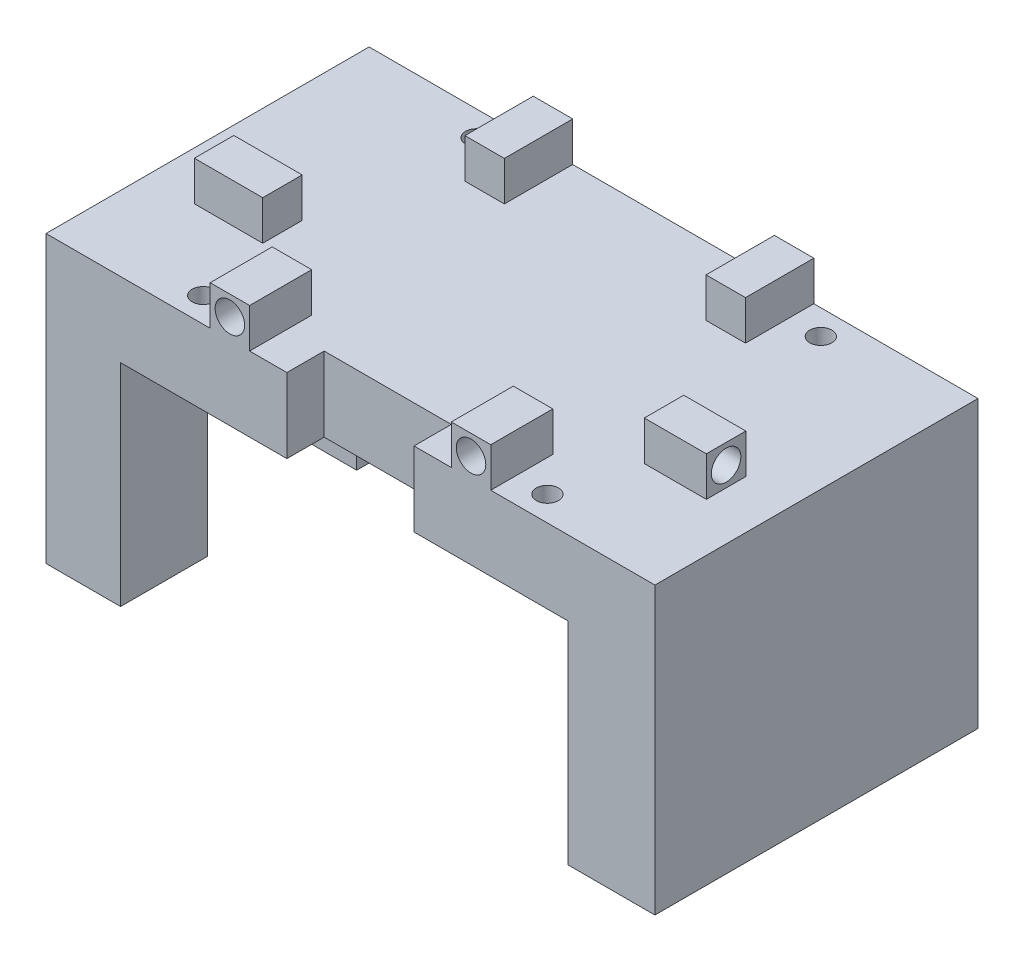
ISO-10303-21;
HEADER;
FILE_DESCRIPTION(('STEP AP214'),'2;1');
FILE_NAME('part.step','',(''),(''),'','','');
FILE_SCHEMA(('AUTOMOTIVE_DESIGN { 1 0 10303 214 1 1 1 1 }'));
ENDSEC;
DATA;
#1=APPLICATION_CONTEXT('core data for automotive mechanical design processes');
#2=APPLICATION_PROTOCOL_DEFINITION('international standard','automotive_design',2000,#1);
#3=PRODUCT_CONTEXT('',#1,'mechanical');
#4=PRODUCT('Part','Part','',(#3));
#5=PRODUCT_RELATED_PRODUCT_CATEGORY('part','',(#4));
#6=PRODUCT_DEFINITION_FORMATION('','',#4);
#7=PRODUCT_DEFINITION_CONTEXT('part definition',#1,'design');
#8=PRODUCT_DEFINITION('design','',#6,#7);
#9=PRODUCT_DEFINITION_SHAPE('','',#8);
#10=(LENGTH_UNIT() NAMED_UNIT(*) SI_UNIT(.MILLI.,.METRE.));
#11=(NAMED_UNIT(*) PLANE_ANGLE_UNIT() SI_UNIT($,.RADIAN.));
#12=(NAMED_UNIT(*) SI_UNIT($,.STERADIAN.) SOLID_ANGLE_UNIT());
#13=UNCERTAINTY_MEASURE_WITH_UNIT(LENGTH_MEASURE(1.E-05),#10,'distance_accuracy_value','');
#14=(GEOMETRIC_REPRESENTATION_CONTEXT(3) GLOBAL_UNCERTAINTY_ASSIGNED_CONTEXT((#13)) GLOBAL_UNIT_ASSIGNED_CONTEXT((#10,
#11,#12)) REPRESENTATION_CONTEXT('',''));
#15=CARTESIAN_POINT('',(0.,0.,0.));
#16=DIRECTION('',(0.,0.,1.));
#17=DIRECTION('',(1.,0.,0.));
#18=AXIS2_PLACEMENT_3D('',#15,#16,#17);
#19=CARTESIAN_POINT('',(0.,0.,0.));
#20=DIRECTION('',(0.,-1.,0.));
#21=DIRECTION('',(0.,0.,-1.));
#22=AXIS2_PLACEMENT_3D('',#19,#20,#21);
#23=PLANE('',#22);
#24=CARTESIAN_POINT('',(10.65,0.,-2.));
#25=DIRECTION('',(0.,1.,0.));
#26=DIRECTION('',(0.,0.,1.));
#27=AXIS2_PLACEMENT_3D('',#24,#25,#26);
#28=CIRCLE('',#27,0.888999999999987);
#29=CARTESIAN_POINT('',(10.65,0.,-1.11100000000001));
#30=VERTEX_POINT('',#29);
#31=EDGE_CURVE('E1187',#30,#30,#28,.T.);
#32=ORIENTED_EDGE('',*,*,#31,.F.);
#33=EDGE_LOOP('',(#32));
#34=FACE_BOUND('',#33,.T.);
#35=CARTESIAN_POINT('',(38.35,0.,-2.));
#36=DIRECTION('',(0.,1.,0.));
#37=DIRECTION('',(0.,0.,1.));
#38=AXIS2_PLACEMENT_3D('',#35,#36,#37);
#39=CIRCLE('',#38,0.888999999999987);
#40=CARTESIAN_POINT('',(38.35,0.,-1.11100000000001));
#41=VERTEX_POINT('',#40);
#42=EDGE_CURVE('E1189',#41,#41,#39,.T.);
#43=ORIENTED_EDGE('',*,*,#42,.F.);
#44=EDGE_LOOP('',(#43));
#45=FACE_BOUND('',#44,.T.);
#46=CARTESIAN_POINT('',(38.35,0.,-24.));
#47=DIRECTION('',(0.,1.,0.));
#48=DIRECTION('',(0.,0.,1.));
#49=AXIS2_PLACEMENT_3D('',#46,#47,#48);
#50=CIRCLE('',#49,0.888999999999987);
#51=CARTESIAN_POINT('',(38.35,0.,-23.111));
#52=VERTEX_POINT('',#51);
#53=EDGE_CURVE('E1197',#52,#52,#50,.T.);
#54=ORIENTED_EDGE('',*,*,#53,.F.);
#55=EDGE_LOOP('',(#54));
#56=FACE_BOUND('',#55,.T.);
#57=DIRECTION('',(0.,0.,-1.));
#58=VECTOR('',#57,1.);
#59=CARTESIAN_POINT('',(19.385,0.,0.));
#60=LINE('',#59,#58);
#61=CARTESIAN_POINT('',(19.385,0.,0.));
#62=VERTEX_POINT('',#61);
#63=CARTESIAN_POINT('',(19.385,0.,-3.));
#64=VERTEX_POINT('',#63);
#65=EDGE_CURVE('E356',#62,#64,#60,.T.);
#66=ORIENTED_EDGE('',*,*,#65,.T.);
#67=DIRECTION('',(1.,0.,0.));
#68=VECTOR('',#67,1.);
#69=CARTESIAN_POINT('',(19.385,0.,-3.));
#70=LINE('',#69,#68);
#71=CARTESIAN_POINT('',(29.615,0.,-3.));
#72=VERTEX_POINT('',#71);
#73=EDGE_CURVE('E359',#64,#72,#70,.T.);
#74=ORIENTED_EDGE('',*,*,#73,.T.);
#75=DIRECTION('',(0.,0.,-1.));
#76=VECTOR('',#75,1.);
#77=CARTESIAN_POINT('',(29.615,0.,0.));
#78=LINE('',#77,#76);
#79=CARTESIAN_POINT('',(29.615,0.,0.));
#80=VERTEX_POINT('',#79);
#81=EDGE_CURVE('E362',#80,#72,#78,.T.);
#82=ORIENTED_EDGE('',*,*,#81,.F.);
#83=DIRECTION('',(1.,0.,0.));
#84=VECTOR('',#83,1.);
#85=CARTESIAN_POINT('',(0.,0.,0.));
#86=LINE('',#85,#84);
#87=CARTESIAN_POINT('',(32.615,0.,0.));
#88=VERTEX_POINT('',#87);
#89=EDGE_CURVE('E569',#80,#88,#86,.T.);
#90=ORIENTED_EDGE('',*,*,#89,.T.);
#91=DIRECTION('',(0.,0.,1.));
#92=VECTOR('',#91,1.);
#93=CARTESIAN_POINT('',(32.615,0.,-4.992));
#94=LINE('',#93,#92);
#95=CARTESIAN_POINT('',(32.615,0.,-4.992));
#96=VERTEX_POINT('',#95);
#97=EDGE_CURVE('E514',#96,#88,#94,.T.);
#98=ORIENTED_EDGE('',*,*,#97,.F.);
#99=DIRECTION('',(-1.,0.,0.));
#100=VECTOR('',#99,1.);
#101=CARTESIAN_POINT('',(32.615,0.,-4.992));
#102=LINE('',#101,#100);
#103=CARTESIAN_POINT('',(35.79,0.,-4.992));
#104=VERTEX_POINT('',#103);
#105=EDGE_CURVE('E519',#104,#96,#102,.T.);
#106=ORIENTED_EDGE('',*,*,#105,.F.);
#107=DIRECTION('',(0.,0.,-1.));
#108=VECTOR('',#107,1.);
#109=CARTESIAN_POINT('',(35.79,0.,-4.992));
#110=LINE('',#109,#108);
#111=CARTESIAN_POINT('',(35.79,0.,0.));
#112=VERTEX_POINT('',#111);
#113=EDGE_CURVE('E528',#112,#104,#110,.T.);
#114=ORIENTED_EDGE('',*,*,#113,.F.);
#115=CARTESIAN_POINT('',(49.,0.,0.));
#116=VERTEX_POINT('',#115);
#117=EDGE_CURVE('E566',#112,#116,#86,.T.);
#118=ORIENTED_EDGE('',*,*,#117,.T.);
#119=DIRECTION('',(0.,0.,-1.));
#120=VECTOR('',#119,1.);
#121=CARTESIAN_POINT('',(49.,0.,0.));
#122=LINE('',#121,#120);
#123=CARTESIAN_POINT('',(49.,0.,-26.));
#124=VERTEX_POINT('',#123);
#125=EDGE_CURVE('E578',#116,#124,#122,.T.);
#126=ORIENTED_EDGE('',*,*,#125,.T.);
#127=DIRECTION('',(-1.,0.,0.));
#128=VECTOR('',#127,1.);
#129=CARTESIAN_POINT('',(0.,0.,-26.));
#130=LINE('',#129,#128);
#131=CARTESIAN_POINT('',(35.79,0.,-26.));
#132=VERTEX_POINT('',#131);
#133=EDGE_CURVE('E592',#124,#132,#130,.T.);
#134=ORIENTED_EDGE('',*,*,#133,.T.);
#135=DIRECTION('',(0.,0.,-1.));
#136=VECTOR('',#135,1.);
#137=CARTESIAN_POINT('',(35.79,0.,-26.));
#138=LINE('',#137,#136);
#139=CARTESIAN_POINT('',(35.79,0.,-20.5));
#140=VERTEX_POINT('',#139);
#141=EDGE_CURVE('E451',#140,#132,#138,.T.);
#142=ORIENTED_EDGE('',*,*,#141,.F.);
#143=DIRECTION('',(1.,0.,0.));
#144=VECTOR('',#143,1.);
#145=CARTESIAN_POINT('',(35.79,0.,-20.5));
#146=LINE('',#145,#144);
#147=CARTESIAN_POINT('',(32.615,0.,-20.5));
#148=VERTEX_POINT('',#147);
#149=EDGE_CURVE('E456',#148,#140,#146,.T.);
#150=ORIENTED_EDGE('',*,*,#149,.F.);
#151=DIRECTION('',(0.,0.,1.));
#152=VECTOR('',#151,1.);
#153=CARTESIAN_POINT('',(32.615,0.,-26.));
#154=LINE('',#153,#152);
#155=CARTESIAN_POINT('',(32.615,0.,-26.));
#156=VERTEX_POINT('',#155);
#157=EDGE_CURVE('E465',#156,#148,#154,.T.);
#158=ORIENTED_EDGE('',*,*,#157,.F.);
#159=CARTESIAN_POINT('',(16.385,0.,-26.));
#160=VERTEX_POINT('',#159);
#161=EDGE_CURVE('E1241',#156,#160,#130,.T.);
#162=ORIENTED_EDGE('',*,*,#161,.T.);
#163=DIRECTION('',(0.,0.,-1.));
#164=VECTOR('',#163,1.);
#165=CARTESIAN_POINT('',(16.385,0.,-26.));
#166=LINE('',#165,#164);
#167=CARTESIAN_POINT('',(16.385,0.,-20.5));
#168=VERTEX_POINT('',#167);
#169=EDGE_CURVE('E421',#168,#160,#166,.T.);
#170=ORIENTED_EDGE('',*,*,#169,.F.);
#171=DIRECTION('',(1.,0.,0.));
#172=VECTOR('',#171,1.);
#173=CARTESIAN_POINT('',(16.385,0.,-20.5));
#174=LINE('',#173,#172);
#175=CARTESIAN_POINT('',(13.21,0.,-20.5));
#176=VERTEX_POINT('',#175);
#177=EDGE_CURVE('E426',#176,#168,#174,.T.);
#178=ORIENTED_EDGE('',*,*,#177,.F.);
#179=DIRECTION('',(0.,0.,1.));
#180=VECTOR('',#179,1.);
#181=CARTESIAN_POINT('',(13.21,0.,-26.));
#182=LINE('',#181,#180);
#183=CARTESIAN_POINT('',(13.21,0.,-26.));
#184=VERTEX_POINT('',#183);
#185=EDGE_CURVE('E435',#184,#176,#182,.T.);
#186=ORIENTED_EDGE('',*,*,#185,.F.);
#187=CARTESIAN_POINT('',(0.,0.,-26.));
#188=VERTEX_POINT('',#187);
#189=EDGE_CURVE('E1237',#184,#188,#130,.T.);
#190=ORIENTED_EDGE('',*,*,#189,.T.);
#191=DIRECTION('',(0.,0.,1.));
#192=VECTOR('',#191,1.);
#193=CARTESIAN_POINT('',(0.,0.,0.));
#194=LINE('',#193,#192);
#195=CARTESIAN_POINT('',(0.,0.,0.));
#196=VERTEX_POINT('',#195);
#197=EDGE_CURVE('E570',#188,#196,#194,.T.);
#198=ORIENTED_EDGE('',*,*,#197,.T.);
#199=CARTESIAN_POINT('',(13.21,0.,0.));
#200=VERTEX_POINT('',#199);
#201=EDGE_CURVE('E587',#196,#200,#86,.T.);
#202=ORIENTED_EDGE('',*,*,#201,.T.);
#203=DIRECTION('',(0.,0.,1.));
#204=VECTOR('',#203,1.);
#205=CARTESIAN_POINT('',(13.21,0.,-4.992));
#206=LINE('',#205,#204);
#207=CARTESIAN_POINT('',(13.21,0.,-4.992));
#208=VERTEX_POINT('',#207);
#209=EDGE_CURVE('E544',#208,#200,#206,.T.);
#210=ORIENTED_EDGE('',*,*,#209,.F.);
#211=DIRECTION('',(-1.,0.,0.));
#212=VECTOR('',#211,1.);
#213=CARTESIAN_POINT('',(13.21,0.,-4.992));
#214=LINE('',#213,#212);
#215=CARTESIAN_POINT('',(16.385,0.,-4.992));
#216=VERTEX_POINT('',#215);
#217=EDGE_CURVE('E549',#216,#208,#214,.T.);
#218=ORIENTED_EDGE('',*,*,#217,.F.);
#219=DIRECTION('',(0.,0.,-1.));
#220=VECTOR('',#219,1.);
#221=CARTESIAN_POINT('',(16.385,0.,-4.992));
#222=LINE('',#221,#220);
#223=CARTESIAN_POINT('',(16.385,0.,0.));
#224=VERTEX_POINT('',#223);
#225=EDGE_CURVE('E563',#224,#216,#222,.T.);
#226=ORIENTED_EDGE('',*,*,#225,.F.);
#227=EDGE_CURVE('E583',#224,#62,#86,.T.);
#228=ORIENTED_EDGE('',*,*,#227,.T.);
#229=EDGE_LOOP('',(#66,#74,#82,#90,#98,#106,#114,#118,#126,#134,#142,#150,#158,#162,#170,#178,
#186,#190,#198,#202,#210,#218,#226,#228));
#230=FACE_BOUND('',#229,.T.);
#231=DIRECTION('',(0.,0.,1.));
#232=VECTOR('',#231,1.);
#233=CARTESIAN_POINT('',(40.108,0.,-8.04));
#234=LINE('',#233,#232);
#235=CARTESIAN_POINT('',(40.108,0.,-11.215));
#236=VERTEX_POINT('',#235);
#237=CARTESIAN_POINT('',(40.108,0.,-8.04));
#238=VERTEX_POINT('',#237);
#239=EDGE_CURVE('E481',#236,#238,#234,.T.);
#240=ORIENTED_EDGE('',*,*,#239,.F.);
#241=DIRECTION('',(-1.,0.,0.));
#242=VECTOR('',#241,1.);
#243=CARTESIAN_POINT('',(40.108,0.,-11.215));
#244=LINE('',#243,#242);
#245=CARTESIAN_POINT('',(45.1,0.,-11.215));
#246=VERTEX_POINT('',#245);
#247=EDGE_CURVE('E486',#246,#236,#244,.T.);
#248=ORIENTED_EDGE('',*,*,#247,.F.);
#249=DIRECTION('',(0.,0.,-1.));
#250=VECTOR('',#249,1.);
#251=CARTESIAN_POINT('',(45.1,0.,-8.04));
#252=LINE('',#251,#250);
#253=CARTESIAN_POINT('',(45.1,0.,-8.04));
#254=VERTEX_POINT('',#253);
#255=EDGE_CURVE('E498',#254,#246,#252,.T.);
#256=ORIENTED_EDGE('',*,*,#255,.F.);
#257=DIRECTION('',(1.,0.,0.));
#258=VECTOR('',#257,1.);
#259=CARTESIAN_POINT('',(40.108,0.,-8.04));
#260=LINE('',#259,#258);
#261=EDGE_CURVE('E495',#238,#254,#260,.T.);
#262=ORIENTED_EDGE('',*,*,#261,.F.);
#263=EDGE_LOOP('',(#240,#248,#256,#262));
#264=FACE_BOUND('',#263,.T.);
#265=DIRECTION('',(0.,0.,-1.));
#266=VECTOR('',#265,1.);
#267=CARTESIAN_POINT('',(9.4,0.,-11.215));
#268=LINE('',#267,#266);
#269=CARTESIAN_POINT('',(9.4,0.,-8.04));
#270=VERTEX_POINT('',#269);
#271=CARTESIAN_POINT('',(9.4,0.,-11.215));
#272=VERTEX_POINT('',#271);
#273=EDGE_CURVE('E391',#270,#272,#268,.T.);
#274=ORIENTED_EDGE('',*,*,#273,.F.);
#275=DIRECTION('',(1.,0.,0.));
#276=VECTOR('',#275,1.);
#277=CARTESIAN_POINT('',(9.4,0.,-8.04));
#278=LINE('',#277,#276);
#279=CARTESIAN_POINT('',(3.9,0.,-8.04));
#280=VERTEX_POINT('',#279);
#281=EDGE_CURVE('E396',#280,#270,#278,.T.);
#282=ORIENTED_EDGE('',*,*,#281,.F.);
#283=DIRECTION('',(0.,0.,1.));
#284=VECTOR('',#283,1.);
#285=CARTESIAN_POINT('',(3.9,0.,-11.215));
#286=LINE('',#285,#284);
#287=CARTESIAN_POINT('',(3.9,0.,-11.215));
#288=VERTEX_POINT('',#287);
#289=EDGE_CURVE('E406',#288,#280,#286,.T.);
#290=ORIENTED_EDGE('',*,*,#289,.F.);
#291=DIRECTION('',(-1.,0.,0.));
#292=VECTOR('',#291,1.);
#293=CARTESIAN_POINT('',(9.4,0.,-11.215));
#294=LINE('',#293,#292);
#295=EDGE_CURVE('E58',#272,#288,#294,.T.);
#296=ORIENTED_EDGE('',*,*,#295,.F.);
#297=EDGE_LOOP('',(#274,#282,#290,#296));
#298=FACE_BOUND('',#297,.T.);
#299=CARTESIAN_POINT('',(10.65,0.,-24.));
#300=DIRECTION('',(0.,1.,0.));
#301=DIRECTION('',(0.,0.,1.));
#302=AXIS2_PLACEMENT_3D('',#299,#300,#301);
#303=CIRCLE('',#302,0.888999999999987);
#304=CARTESIAN_POINT('',(10.65,0.,-23.111));
#305=VERTEX_POINT('',#304);
#306=EDGE_CURVE('E1203',#305,#305,#303,.T.);
#307=ORIENTED_EDGE('',*,*,#306,.F.);
#308=EDGE_LOOP('',(#307));
#309=FACE_BOUND('',#308,.T.);
#310=ADVANCED_FACE('F35',(#34,#45,#56,#230,#264,#298,#309),#23,.F.);
#311=CARTESIAN_POINT('',(0.,-6.,0.));
#312=DIRECTION('',(0.,-1.,0.));
#313=DIRECTION('',(0.,0.,-1.));
#314=AXIS2_PLACEMENT_3D('',#311,#312,#313);
#315=PLANE('',#314);
#316=CARTESIAN_POINT('',(10.65,-6.,-2.));
#317=DIRECTION('',(0.,-1.,0.));
#318=DIRECTION('',(0.,0.,-1.));
#319=AXIS2_PLACEMENT_3D('',#316,#317,#318);
#320=CIRCLE('',#319,0.88899999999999);
#321=CARTESIAN_POINT('',(10.65,-6.,-2.88899999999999));
#322=VERTEX_POINT('',#321);
#323=EDGE_CURVE('E1185',#322,#322,#320,.T.);
#324=ORIENTED_EDGE('',*,*,#323,.F.);
#325=EDGE_LOOP('',(#324));
#326=FACE_BOUND('',#325,.T.);
#327=CARTESIAN_POINT('',(38.35,-6.,-2.));
#328=DIRECTION('',(0.,-1.,0.));
#329=DIRECTION('',(0.,0.,-1.));
#330=AXIS2_PLACEMENT_3D('',#327,#328,#329);
#331=CIRCLE('',#330,0.88899999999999);
#332=CARTESIAN_POINT('',(38.35,-6.,-2.88899999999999));
#333=VERTEX_POINT('',#332);
#334=EDGE_CURVE('E1194',#333,#333,#331,.T.);
#335=ORIENTED_EDGE('',*,*,#334,.F.);
#336=EDGE_LOOP('',(#335));
#337=FACE_BOUND('',#336,.T.);
#338=CARTESIAN_POINT('',(38.35,-6.,-24.));
#339=DIRECTION('',(0.,-1.,0.));
#340=DIRECTION('',(0.,0.,-1.));
#341=AXIS2_PLACEMENT_3D('',#338,#339,#340);
#342=CIRCLE('',#341,0.88899999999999);
#343=CARTESIAN_POINT('',(38.35,-6.,-24.889));
#344=VERTEX_POINT('',#343);
#345=EDGE_CURVE('E1200',#344,#344,#342,.T.);
#346=ORIENTED_EDGE('',*,*,#345,.F.);
#347=EDGE_LOOP('',(#346));
#348=FACE_BOUND('',#347,.T.);
#349=CARTESIAN_POINT('',(10.65,-6.,-24.));
#350=DIRECTION('',(0.,-1.,0.));
#351=DIRECTION('',(0.,0.,-1.));
#352=AXIS2_PLACEMENT_3D('',#349,#350,#351);
#353=CIRCLE('',#352,0.88899999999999);
#354=CARTESIAN_POINT('',(10.65,-6.,-24.889));
#355=VERTEX_POINT('',#354);
#356=EDGE_CURVE('E326',#355,#355,#353,.T.);
#357=ORIENTED_EDGE('',*,*,#356,.F.);
#358=EDGE_LOOP('',(#357));
#359=FACE_BOUND('',#358,.T.);
#360=DIRECTION('',(-1.,0.,0.));
#361=VECTOR('',#360,1.);
#362=CARTESIAN_POINT('',(0.,-6.,-3.));
#363=LINE('',#362,#361);
#364=CARTESIAN_POINT('',(29.615,-6.,-3.));
#365=VERTEX_POINT('',#364);
#366=CARTESIAN_POINT('',(19.385,-6.,-3.));
#367=VERTEX_POINT('',#366);
#368=EDGE_CURVE('E11',#365,#367,#363,.T.);
#369=ORIENTED_EDGE('',*,*,#368,.T.);
#370=DIRECTION('',(0.,0.,1.));
#371=VECTOR('',#370,1.);
#372=CARTESIAN_POINT('',(19.385,-6.,0.));
#373=LINE('',#372,#371);
#374=CARTESIAN_POINT('',(19.385,-6.,0.));
#375=VERTEX_POINT('',#374);
#376=EDGE_CURVE('E370',#367,#375,#373,.T.);
#377=ORIENTED_EDGE('',*,*,#376,.T.);
#378=DIRECTION('',(1.,0.,0.));
#379=VECTOR('',#378,1.);
#380=CARTESIAN_POINT('',(0.,-6.,0.));
#381=LINE('',#380,#379);
#382=CARTESIAN_POINT('',(6.,-6.,0.));
#383=VERTEX_POINT('',#382);
#384=EDGE_CURVE('E603',#383,#375,#381,.T.);
#385=ORIENTED_EDGE('',*,*,#384,.F.);
#386=DIRECTION('',(0.,0.,1.));
#387=VECTOR('',#386,1.);
#388=CARTESIAN_POINT('',(6.,-6.,0.));
#389=LINE('',#388,#387);
#390=CARTESIAN_POINT('',(6.,-6.,-7.));
#391=VERTEX_POINT('',#390);
#392=EDGE_CURVE('E612',#391,#383,#389,.T.);
#393=ORIENTED_EDGE('',*,*,#392,.F.);
#394=DIRECTION('',(1.,0.,0.));
#395=VECTOR('',#394,1.);
#396=CARTESIAN_POINT('',(0.,-6.,-7.));
#397=LINE('',#396,#395);
#398=CARTESIAN_POINT('',(0.,-6.,-6.99999999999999));
#399=VERTEX_POINT('',#398);
#400=EDGE_CURVE('E609',#399,#391,#397,.T.);
#401=ORIENTED_EDGE('',*,*,#400,.F.);
#402=DIRECTION('',(0.,0.,1.));
#403=VECTOR('',#402,1.);
#404=CARTESIAN_POINT('',(0.,-6.,0.));
#405=LINE('',#404,#403);
#406=CARTESIAN_POINT('',(0.,-6.,-19.));
#407=VERTEX_POINT('',#406);
#408=EDGE_CURVE('E589',#407,#399,#405,.T.);
#409=ORIENTED_EDGE('',*,*,#408,.F.);
#410=DIRECTION('',(-1.,0.,0.));
#411=VECTOR('',#410,1.);
#412=CARTESIAN_POINT('',(0.,-6.,-19.));
#413=LINE('',#412,#411);
#414=CARTESIAN_POINT('',(6.,-6.,-19.));
#415=VERTEX_POINT('',#414);
#416=EDGE_CURVE('E643',#415,#407,#413,.T.);
#417=ORIENTED_EDGE('',*,*,#416,.F.);
#418=DIRECTION('',(0.,0.,1.));
#419=VECTOR('',#418,1.);
#420=CARTESIAN_POINT('',(6.,-6.,-26.));
#421=LINE('',#420,#419);
#422=CARTESIAN_POINT('',(6.,-6.,-26.));
#423=VERTEX_POINT('',#422);
#424=EDGE_CURVE('E646',#423,#415,#421,.T.);
#425=ORIENTED_EDGE('',*,*,#424,.F.);
#426=DIRECTION('',(-1.,0.,0.));
#427=VECTOR('',#426,1.);
#428=CARTESIAN_POINT('',(0.,-6.,-26.));
#429=LINE('',#428,#427);
#430=CARTESIAN_POINT('',(42.,-6.,-26.));
#431=VERTEX_POINT('',#430);
#432=EDGE_CURVE('E600',#431,#423,#429,.T.);
#433=ORIENTED_EDGE('',*,*,#432,.F.);
#434=DIRECTION('',(0.,0.,-1.));
#435=VECTOR('',#434,1.);
#436=CARTESIAN_POINT('',(42.,-6.,0.));
#437=LINE('',#436,#435);
#438=CARTESIAN_POINT('',(42.,-6.,0.));
#439=VERTEX_POINT('',#438);
#440=EDGE_CURVE('E663',#439,#431,#437,.T.);
#441=ORIENTED_EDGE('',*,*,#440,.F.);
#442=CARTESIAN_POINT('',(29.615,-6.,0.));
#443=VERTEX_POINT('',#442);
#444=EDGE_CURVE('E571',#443,#439,#381,.T.);
#445=ORIENTED_EDGE('',*,*,#444,.F.);
#446=DIRECTION('',(0.,0.,1.));
#447=VECTOR('',#446,1.);
#448=CARTESIAN_POINT('',(29.615,-6.,0.));
#449=LINE('',#448,#447);
#450=EDGE_CURVE('E50',#365,#443,#449,.T.);
#451=ORIENTED_EDGE('',*,*,#450,.F.);
#452=EDGE_LOOP('',(#369,#377,#385,#393,#401,#409,#417,#425,#433,#441,#445,#451));
#453=FACE_BOUND('',#452,.T.);
#454=ADVANCED_FACE('F720',(#326,#337,#348,#359,#453),#315,.T.);
#455=CARTESIAN_POINT('',(0.,-6.,0.));
#456=DIRECTION('',(0.,0.,1.));
#457=DIRECTION('',(1.,0.,0.));
#458=AXIS2_PLACEMENT_3D('',#455,#456,#457);
#459=PLANE('',#458);
#460=CARTESIAN_POINT('',(14.7975,1.5875,0.));
#461=DIRECTION('',(0.,0.,1.));
#462=DIRECTION('',(1.,0.,0.));
#463=AXIS2_PLACEMENT_3D('',#460,#461,#462);
#464=CIRCLE('',#463,1.18744999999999);
#465=CARTESIAN_POINT('',(15.98495,1.5875,0.));
#466=VERTEX_POINT('',#465);
#467=EDGE_CURVE('E379',#466,#466,#464,.T.);
#468=ORIENTED_EDGE('',*,*,#467,.F.);
#469=EDGE_LOOP('',(#468));
#470=FACE_BOUND('',#469,.T.);
#471=ORIENTED_EDGE('',*,*,#384,.T.);
#472=DIRECTION('',(0.,1.,0.));
#473=VECTOR('',#472,1.);
#474=CARTESIAN_POINT('',(19.385,-6.,0.));
#475=LINE('',#474,#473);
#476=EDGE_CURVE('E43',#375,#62,#475,.T.);
#477=ORIENTED_EDGE('',*,*,#476,.T.);
#478=ORIENTED_EDGE('',*,*,#227,.F.);
#479=DIRECTION('',(0.,-1.,0.));
#480=VECTOR('',#479,1.);
#481=CARTESIAN_POINT('',(16.385,3.175,0.));
#482=LINE('',#481,#480);
#483=CARTESIAN_POINT('',(16.385,3.175,0.));
#484=VERTEX_POINT('',#483);
#485=EDGE_CURVE('E677',#484,#224,#482,.T.);
#486=ORIENTED_EDGE('',*,*,#485,.F.);
#487=DIRECTION('',(1.,0.,0.));
#488=VECTOR('',#487,1.);
#489=CARTESIAN_POINT('',(13.21,3.175,0.));
#490=LINE('',#489,#488);
#491=CARTESIAN_POINT('',(13.21,3.175,0.));
#492=VERTEX_POINT('',#491);
#493=EDGE_CURVE('E548',#492,#484,#490,.T.);
#494=ORIENTED_EDGE('',*,*,#493,.F.);
#495=DIRECTION('',(0.,-1.,0.));
#496=VECTOR('',#495,1.);
#497=CARTESIAN_POINT('',(13.21,3.175,0.));
#498=LINE('',#497,#496);
#499=EDGE_CURVE('E666',#492,#200,#498,.T.);
#500=ORIENTED_EDGE('',*,*,#499,.T.);
#501=ORIENTED_EDGE('',*,*,#201,.F.);
#502=DIRECTION('',(0.,1.,0.));
#503=VECTOR('',#502,1.);
#504=CARTESIAN_POINT('',(0.,-6.,0.));
#505=LINE('',#504,#503);
#506=CARTESIAN_POINT('',(0.,-23.,0.));
#507=VERTEX_POINT('',#506);
#508=EDGE_CURVE('E607',#507,#196,#505,.T.);
#509=ORIENTED_EDGE('',*,*,#508,.F.);
#510=DIRECTION('',(-1.,0.,0.));
#511=VECTOR('',#510,1.);
#512=CARTESIAN_POINT('',(0.,-23.,0.));
#513=LINE('',#512,#511);
#514=CARTESIAN_POINT('',(6.,-23.,0.));
#515=VERTEX_POINT('',#514);
#516=EDGE_CURVE('E626',#515,#507,#513,.T.);
#517=ORIENTED_EDGE('',*,*,#516,.F.);
#518=DIRECTION('',(0.,1.,0.));
#519=VECTOR('',#518,1.);
#520=CARTESIAN_POINT('',(6.,-23.,0.));
#521=LINE('',#520,#519);
#522=EDGE_CURVE('E623',#515,#383,#521,.T.);
#523=ORIENTED_EDGE('',*,*,#522,.T.);
#524=EDGE_LOOP('',(#471,#477,#478,#486,#494,#500,#501,#509,#517,#523));
#525=FACE_BOUND('',#524,.T.);
#526=ADVANCED_FACE('F701',(#470,#525),#459,.T.);
#527=CARTESIAN_POINT('',(0.,-6.,0.));
#528=DIRECTION('',(-1.,0.,0.));
#529=DIRECTION('',(0.,0.,1.));
#530=AXIS2_PLACEMENT_3D('',#527,#528,#529);
#531=PLANE('',#530);
#532=ORIENTED_EDGE('',*,*,#197,.F.);
#533=DIRECTION('',(0.,1.,0.));
#534=VECTOR('',#533,1.);
#535=CARTESIAN_POINT('',(0.,-6.,-26.));
#536=LINE('',#535,#534);
#537=CARTESIAN_POINT('',(0.,-23.,-26.));
#538=VERTEX_POINT('',#537);
#539=EDGE_CURVE('E1220',#538,#188,#536,.T.);
#540=ORIENTED_EDGE('',*,*,#539,.F.);
#541=DIRECTION('',(0.,0.,-1.));
#542=VECTOR('',#541,1.);
#543=CARTESIAN_POINT('',(0.,-23.,-26.));
#544=LINE('',#543,#542);
#545=CARTESIAN_POINT('',(0.,-23.,-19.));
#546=VERTEX_POINT('',#545);
#547=EDGE_CURVE('E645',#546,#538,#544,.T.);
#548=ORIENTED_EDGE('',*,*,#547,.F.);
#549=DIRECTION('',(0.,1.,0.));
#550=VECTOR('',#549,1.);
#551=CARTESIAN_POINT('',(0.,-23.,-19.));
#552=LINE('',#551,#550);
#553=EDGE_CURVE('E639',#546,#407,#552,.T.);
#554=ORIENTED_EDGE('',*,*,#553,.T.);
#555=ORIENTED_EDGE('',*,*,#408,.T.);
#556=DIRECTION('',(0.,1.,0.));
#557=VECTOR('',#556,1.);
#558=CARTESIAN_POINT('',(0.,-23.,-7.));
#559=LINE('',#558,#557);
#560=CARTESIAN_POINT('',(0.,-23.,-7.));
#561=VERTEX_POINT('',#560);
#562=EDGE_CURVE('E616',#561,#399,#559,.T.);
#563=ORIENTED_EDGE('',*,*,#562,.F.);
#564=DIRECTION('',(0.,0.,-1.));
#565=VECTOR('',#564,1.);
#566=CARTESIAN_POINT('',(0.,-23.,0.));
#567=LINE('',#566,#565);
#568=EDGE_CURVE('E622',#507,#561,#567,.T.);
#569=ORIENTED_EDGE('',*,*,#568,.F.);
#570=ORIENTED_EDGE('',*,*,#508,.T.);
#571=EDGE_LOOP('',(#532,#540,#548,#554,#555,#563,#569,#570));
#572=FACE_BOUND('',#571,.T.);
#573=ADVANCED_FACE('F37',(#572),#531,.T.);
#574=CARTESIAN_POINT('',(0.,-6.,-26.));
#575=DIRECTION('',(0.,0.,-1.));
#576=DIRECTION('',(-1.,0.,0.));
#577=AXIS2_PLACEMENT_3D('',#574,#575,#576);
#578=PLANE('',#577);
#579=ORIENTED_EDGE('',*,*,#133,.F.);
#580=DIRECTION('',(0.,1.,0.));
#581=VECTOR('',#580,1.);
#582=CARTESIAN_POINT('',(49.,-6.,-26.));
#583=LINE('',#582,#581);
#584=CARTESIAN_POINT('',(49.,-23.,-26.));
#585=VERTEX_POINT('',#584);
#586=EDGE_CURVE('E1239',#585,#124,#583,.T.);
#587=ORIENTED_EDGE('',*,*,#586,.F.);
#588=DIRECTION('',(1.,0.,0.));
#589=VECTOR('',#588,1.);
#590=CARTESIAN_POINT('',(49.,-23.,-26.));
#591=LINE('',#590,#589);
#592=CARTESIAN_POINT('',(42.,-23.,-26.));
#593=VERTEX_POINT('',#592);
#594=EDGE_CURVE('E662',#593,#585,#591,.T.);
#595=ORIENTED_EDGE('',*,*,#594,.F.);
#596=DIRECTION('',(0.,1.,0.));
#597=VECTOR('',#596,1.);
#598=CARTESIAN_POINT('',(42.,-23.,-26.));
#599=LINE('',#598,#597);
#600=EDGE_CURVE('E659',#593,#431,#599,.T.);
#601=ORIENTED_EDGE('',*,*,#600,.T.);
#602=ORIENTED_EDGE('',*,*,#432,.T.);
#603=DIRECTION('',(0.,1.,0.));
#604=VECTOR('',#603,1.);
#605=CARTESIAN_POINT('',(6.,-23.,-26.));
#606=LINE('',#605,#604);
#607=CARTESIAN_POINT('',(6.,-23.,-26.));
#608=VERTEX_POINT('',#607);
#609=EDGE_CURVE('E613',#608,#423,#606,.T.);
#610=ORIENTED_EDGE('',*,*,#609,.F.);
#611=DIRECTION('',(1.,0.,0.));
#612=VECTOR('',#611,1.);
#613=CARTESIAN_POINT('',(0.,-23.,-26.));
#614=LINE('',#613,#612);
#615=EDGE_CURVE('E653',#538,#608,#614,.T.);
#616=ORIENTED_EDGE('',*,*,#615,.F.);
#617=ORIENTED_EDGE('',*,*,#539,.T.);
#618=ORIENTED_EDGE('',*,*,#189,.F.);
#619=DIRECTION('',(0.,-1.,0.));
#620=VECTOR('',#619,1.);
#621=CARTESIAN_POINT('',(13.21,3.175,-26.));
#622=LINE('',#621,#620);
#623=CARTESIAN_POINT('',(13.21,3.175,-26.));
#624=VERTEX_POINT('',#623);
#625=EDGE_CURVE('E445',#624,#184,#622,.T.);
#626=ORIENTED_EDGE('',*,*,#625,.F.);
#627=DIRECTION('',(-1.,0.,0.));
#628=VECTOR('',#627,1.);
#629=CARTESIAN_POINT('',(16.385,3.175,-26.));
#630=LINE('',#629,#628);
#631=CARTESIAN_POINT('',(16.385,3.175,-26.));
#632=VERTEX_POINT('',#631);
#633=EDGE_CURVE('E425',#632,#624,#630,.T.);
#634=ORIENTED_EDGE('',*,*,#633,.F.);
#635=DIRECTION('',(0.,-1.,0.));
#636=VECTOR('',#635,1.);
#637=CARTESIAN_POINT('',(16.385,3.175,-26.));
#638=LINE('',#637,#636);
#639=EDGE_CURVE('E448',#632,#160,#638,.T.);
#640=ORIENTED_EDGE('',*,*,#639,.T.);
#641=ORIENTED_EDGE('',*,*,#161,.F.);
#642=DIRECTION('',(0.,-1.,0.));
#643=VECTOR('',#642,1.);
#644=CARTESIAN_POINT('',(32.615,3.175,-26.));
#645=LINE('',#644,#643);
#646=CARTESIAN_POINT('',(32.615,3.175,-26.));
#647=VERTEX_POINT('',#646);
#648=EDGE_CURVE('E475',#647,#156,#645,.T.);
#649=ORIENTED_EDGE('',*,*,#648,.F.);
#650=DIRECTION('',(-1.,0.,0.));
#651=VECTOR('',#650,1.);
#652=CARTESIAN_POINT('',(35.79,3.175,-26.));
#653=LINE('',#652,#651);
#654=CARTESIAN_POINT('',(35.79,3.175,-26.));
#655=VERTEX_POINT('',#654);
#656=EDGE_CURVE('E455',#655,#647,#653,.T.);
#657=ORIENTED_EDGE('',*,*,#656,.F.);
#658=DIRECTION('',(0.,-1.,0.));
#659=VECTOR('',#658,1.);
#660=CARTESIAN_POINT('',(35.79,3.175,-26.));
#661=LINE('',#660,#659);
#662=EDGE_CURVE('E478',#655,#132,#661,.T.);
#663=ORIENTED_EDGE('',*,*,#662,.T.);
#664=EDGE_LOOP('',(#579,#587,#595,#601,#602,#610,#616,#617,#618,#626,#634,#640,#641,#649,#657,#663));
#665=FACE_BOUND('',#664,.T.);
#666=ADVANCED_FACE('F732',(#665),#578,.T.);
#667=CARTESIAN_POINT('',(49.,-6.,0.));
#668=DIRECTION('',(1.,0.,0.));
#669=DIRECTION('',(0.,0.,-1.));
#670=AXIS2_PLACEMENT_3D('',#667,#668,#669);
#671=PLANE('',#670);
#672=ORIENTED_EDGE('',*,*,#125,.F.);
#673=DIRECTION('',(0.,1.,0.));
#674=VECTOR('',#673,1.);
#675=CARTESIAN_POINT('',(49.,-6.,0.));
#676=LINE('',#675,#674);
#677=CARTESIAN_POINT('',(49.,-23.,0.));
#678=VERTEX_POINT('',#677);
#679=EDGE_CURVE('E1233',#678,#116,#676,.T.);
#680=ORIENTED_EDGE('',*,*,#679,.F.);
#681=DIRECTION('',(0.,0.,1.));
#682=VECTOR('',#681,1.);
#683=CARTESIAN_POINT('',(49.,-23.,0.));
#684=LINE('',#683,#682);
#685=EDGE_CURVE('E665',#585,#678,#684,.T.);
#686=ORIENTED_EDGE('',*,*,#685,.F.);
#687=ORIENTED_EDGE('',*,*,#586,.T.);
#688=EDGE_LOOP('',(#672,#680,#686,#687));
#689=FACE_BOUND('',#688,.T.);
#690=ADVANCED_FACE('F735',(#689),#671,.T.);
#691=DIRECTION('',(0.,1.,0.));
#692=VECTOR('',#691,1.);
#693=CARTESIAN_POINT('',(29.615,-6.,0.));
#694=LINE('',#693,#692);
#695=EDGE_CURVE('E1214',#443,#80,#694,.T.);
#696=ORIENTED_EDGE('',*,*,#695,.F.);
#697=ORIENTED_EDGE('',*,*,#444,.T.);
#698=DIRECTION('',(0.,1.,0.));
#699=VECTOR('',#698,1.);
#700=CARTESIAN_POINT('',(42.,-23.,0.));
#701=LINE('',#700,#699);
#702=CARTESIAN_POINT('',(42.,-23.,0.));
#703=VERTEX_POINT('',#702);
#704=EDGE_CURVE('E649',#703,#439,#701,.T.);
#705=ORIENTED_EDGE('',*,*,#704,.F.);
#706=DIRECTION('',(-1.,0.,0.));
#707=VECTOR('',#706,1.);
#708=CARTESIAN_POINT('',(49.,-23.,0.));
#709=LINE('',#708,#707);
#710=EDGE_CURVE('E671',#678,#703,#709,.T.);
#711=ORIENTED_EDGE('',*,*,#710,.F.);
#712=ORIENTED_EDGE('',*,*,#679,.T.);
#713=ORIENTED_EDGE('',*,*,#117,.F.);
#714=DIRECTION('',(0.,-1.,0.));
#715=VECTOR('',#714,1.);
#716=CARTESIAN_POINT('',(35.79,3.175,0.));
#717=LINE('',#716,#715);
#718=CARTESIAN_POINT('',(35.79,3.175,0.));
#719=VERTEX_POINT('',#718);
#720=EDGE_CURVE('E538',#719,#112,#717,.T.);
#721=ORIENTED_EDGE('',*,*,#720,.F.);
#722=DIRECTION('',(1.,0.,0.));
#723=VECTOR('',#722,1.);
#724=CARTESIAN_POINT('',(32.615,3.175,0.));
#725=LINE('',#724,#723);
#726=CARTESIAN_POINT('',(32.615,3.175,0.));
#727=VERTEX_POINT('',#726);
#728=EDGE_CURVE('E518',#727,#719,#725,.T.);
#729=ORIENTED_EDGE('',*,*,#728,.F.);
#730=DIRECTION('',(0.,-1.,0.));
#731=VECTOR('',#730,1.);
#732=CARTESIAN_POINT('',(32.615,3.175,0.));
#733=LINE('',#732,#731);
#734=EDGE_CURVE('E541',#727,#88,#733,.T.);
#735=ORIENTED_EDGE('',*,*,#734,.T.);
#736=ORIENTED_EDGE('',*,*,#89,.F.);
#737=EDGE_LOOP('',(#696,#697,#705,#711,#712,#713,#721,#729,#735,#736));
#738=FACE_BOUND('',#737,.T.);
#739=CARTESIAN_POINT('',(34.2025,1.5875,0.));
#740=DIRECTION('',(0.,0.,1.));
#741=DIRECTION('',(1.,0.,0.));
#742=AXIS2_PLACEMENT_3D('',#739,#740,#741);
#743=CIRCLE('',#742,1.18744999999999);
#744=CARTESIAN_POINT('',(35.38995,1.5875,0.));
#745=VERTEX_POINT('',#744);
#746=EDGE_CURVE('E385',#745,#745,#743,.T.);
#747=ORIENTED_EDGE('',*,*,#746,.F.);
#748=EDGE_LOOP('',(#747));
#749=FACE_BOUND('',#748,.T.);
#750=ADVANCED_FACE('F738',(#738,#749),#459,.T.);
#751=CARTESIAN_POINT('',(0.,-23.,-7.));
#752=DIRECTION('',(0.,0.,1.));
#753=DIRECTION('',(1.,0.,0.));
#754=AXIS2_PLACEMENT_3D('',#751,#752,#753);
#755=PLANE('',#754);
#756=ORIENTED_EDGE('',*,*,#400,.T.);
#757=DIRECTION('',(0.,1.,0.));
#758=VECTOR('',#757,1.);
#759=CARTESIAN_POINT('',(6.,-23.,-7.));
#760=LINE('',#759,#758);
#761=CARTESIAN_POINT('',(6.,-23.,-7.));
#762=VERTEX_POINT('',#761);
#763=EDGE_CURVE('E597',#762,#391,#760,.T.);
#764=ORIENTED_EDGE('',*,*,#763,.F.);
#765=DIRECTION('',(1.,0.,0.));
#766=VECTOR('',#765,1.);
#767=CARTESIAN_POINT('',(0.,-23.,-7.));
#768=LINE('',#767,#766);
#769=EDGE_CURVE('E631',#561,#762,#768,.T.);
#770=ORIENTED_EDGE('',*,*,#769,.F.);
#771=ORIENTED_EDGE('',*,*,#562,.T.);
#772=EDGE_LOOP('',(#756,#764,#770,#771));
#773=FACE_BOUND('',#772,.T.);
#774=ADVANCED_FACE('F741',(#773),#755,.F.);
#775=CARTESIAN_POINT('',(6.,-23.,0.));
#776=DIRECTION('',(-1.,0.,0.));
#777=DIRECTION('',(0.,0.,1.));
#778=AXIS2_PLACEMENT_3D('',#775,#776,#777);
#779=PLANE('',#778);
#780=ORIENTED_EDGE('',*,*,#392,.T.);
#781=ORIENTED_EDGE('',*,*,#522,.F.);
#782=DIRECTION('',(0.,0.,1.));
#783=VECTOR('',#782,1.);
#784=CARTESIAN_POINT('',(6.,-23.,0.));
#785=LINE('',#784,#783);
#786=EDGE_CURVE('E629',#762,#515,#785,.T.);
#787=ORIENTED_EDGE('',*,*,#786,.F.);
#788=ORIENTED_EDGE('',*,*,#763,.T.);
#789=EDGE_LOOP('',(#780,#781,#787,#788));
#790=FACE_BOUND('',#789,.T.);
#791=ADVANCED_FACE('F746',(#790),#779,.F.);
#792=CARTESIAN_POINT('',(0.,-23.,0.));
#793=DIRECTION('',(0.,-1.,0.));
#794=DIRECTION('',(0.,0.,-1.));
#795=AXIS2_PLACEMENT_3D('',#792,#793,#794);
#796=PLANE('',#795);
#797=CARTESIAN_POINT('',(3.,-23.,-3.5));
#798=DIRECTION('',(0.,-1.,0.));
#799=DIRECTION('',(0.,0.,-1.));
#800=AXIS2_PLACEMENT_3D('',#797,#798,#799);
#801=CIRCLE('',#800,1.1303);
#802=CARTESIAN_POINT('',(3.,-23.,-4.6303));
#803=VERTEX_POINT('',#802);
#804=EDGE_CURVE('E350',#803,#803,#801,.T.);
#805=ORIENTED_EDGE('',*,*,#804,.F.);
#806=EDGE_LOOP('',(#805));
#807=FACE_BOUND('',#806,.T.);
#808=ORIENTED_EDGE('',*,*,#568,.T.);
#809=ORIENTED_EDGE('',*,*,#769,.T.);
#810=ORIENTED_EDGE('',*,*,#786,.T.);
#811=ORIENTED_EDGE('',*,*,#516,.T.);
#812=EDGE_LOOP('',(#808,#809,#810,#811));
#813=FACE_BOUND('',#812,.T.);
#814=ADVANCED_FACE('F1285',(#807,#813),#796,.T.);
#815=CARTESIAN_POINT('',(6.,-23.,-26.));
#816=DIRECTION('',(-1.,0.,0.));
#817=DIRECTION('',(0.,0.,1.));
#818=AXIS2_PLACEMENT_3D('',#815,#816,#817);
#819=PLANE('',#818);
#820=ORIENTED_EDGE('',*,*,#424,.T.);
#821=DIRECTION('',(0.,1.,0.));
#822=VECTOR('',#821,1.);
#823=CARTESIAN_POINT('',(6.,-23.,-19.));
#824=LINE('',#823,#822);
#825=CARTESIAN_POINT('',(6.,-23.,-19.));
#826=VERTEX_POINT('',#825);
#827=EDGE_CURVE('E637',#826,#415,#824,.T.);
#828=ORIENTED_EDGE('',*,*,#827,.F.);
#829=DIRECTION('',(0.,0.,1.));
#830=VECTOR('',#829,1.);
#831=CARTESIAN_POINT('',(6.,-23.,-26.));
#832=LINE('',#831,#830);
#833=EDGE_CURVE('E651',#608,#826,#832,.T.);
#834=ORIENTED_EDGE('',*,*,#833,.F.);
#835=ORIENTED_EDGE('',*,*,#609,.T.);
#836=EDGE_LOOP('',(#820,#828,#834,#835));
#837=FACE_BOUND('',#836,.T.);
#838=ADVANCED_FACE('F1259',(#837),#819,.F.);
#839=CARTESIAN_POINT('',(0.,-23.,-19.));
#840=DIRECTION('',(0.,0.,-1.));
#841=DIRECTION('',(-1.,0.,0.));
#842=AXIS2_PLACEMENT_3D('',#839,#840,#841);
#843=PLANE('',#842);
#844=ORIENTED_EDGE('',*,*,#416,.T.);
#845=ORIENTED_EDGE('',*,*,#553,.F.);
#846=DIRECTION('',(-1.,0.,0.));
#847=VECTOR('',#846,1.);
#848=CARTESIAN_POINT('',(0.,-23.,-19.));
#849=LINE('',#848,#847);
#850=EDGE_CURVE('E642',#826,#546,#849,.T.);
#851=ORIENTED_EDGE('',*,*,#850,.F.);
#852=ORIENTED_EDGE('',*,*,#827,.T.);
#853=EDGE_LOOP('',(#844,#845,#851,#852));
#854=FACE_BOUND('',#853,.T.);
#855=ADVANCED_FACE('F1266',(#854),#843,.F.);
#856=CARTESIAN_POINT('',(0.,-23.,0.));
#857=DIRECTION('',(0.,1.,0.));
#858=DIRECTION('',(0.,0.,1.));
#859=AXIS2_PLACEMENT_3D('',#856,#857,#858);
#860=PLANE('',#859);
#861=CARTESIAN_POINT('',(3.,-23.,-22.5));
#862=DIRECTION('',(0.,-1.,0.));
#863=DIRECTION('',(0.,0.,-1.));
#864=AXIS2_PLACEMENT_3D('',#861,#862,#863);
#865=CIRCLE('',#864,1.1303);
#866=CARTESIAN_POINT('',(3.,-23.,-23.6303));
#867=VERTEX_POINT('',#866);
#868=EDGE_CURVE('E344',#867,#867,#865,.T.);
#869=ORIENTED_EDGE('',*,*,#868,.F.);
#870=EDGE_LOOP('',(#869));
#871=FACE_BOUND('',#870,.T.);
#872=ORIENTED_EDGE('',*,*,#547,.T.);
#873=ORIENTED_EDGE('',*,*,#615,.T.);
#874=ORIENTED_EDGE('',*,*,#833,.T.);
#875=ORIENTED_EDGE('',*,*,#850,.T.);
#876=EDGE_LOOP('',(#872,#873,#874,#875));
#877=FACE_BOUND('',#876,.T.);
#878=ADVANCED_FACE('F1269',(#871,#877),#860,.F.);
#879=CARTESIAN_POINT('',(42.,-23.,0.));
#880=DIRECTION('',(1.,0.,0.));
#881=DIRECTION('',(0.,0.,-1.));
#882=AXIS2_PLACEMENT_3D('',#879,#880,#881);
#883=PLANE('',#882);
#884=ORIENTED_EDGE('',*,*,#440,.T.);
#885=ORIENTED_EDGE('',*,*,#600,.F.);
#886=DIRECTION('',(0.,0.,-1.));
#887=VECTOR('',#886,1.);
#888=CARTESIAN_POINT('',(42.,-23.,0.));
#889=LINE('',#888,#887);
#890=EDGE_CURVE('E669',#703,#593,#889,.T.);
#891=ORIENTED_EDGE('',*,*,#890,.F.);
#892=ORIENTED_EDGE('',*,*,#704,.T.);
#893=EDGE_LOOP('',(#884,#885,#891,#892));
#894=FACE_BOUND('',#893,.T.);
#895=ADVANCED_FACE('F1271',(#894),#883,.F.);
#896=CARTESIAN_POINT('',(0.,-23.,0.));
#897=DIRECTION('',(0.,1.,0.));
#898=DIRECTION('',(0.,0.,1.));
#899=AXIS2_PLACEMENT_3D('',#896,#897,#898);
#900=PLANE('',#899);
#901=CARTESIAN_POINT('',(45.5,-23.,-10.5));
#902=DIRECTION('',(0.,-1.,0.));
#903=DIRECTION('',(0.,0.,-1.));
#904=AXIS2_PLACEMENT_3D('',#901,#902,#903);
#905=CIRCLE('',#904,1.5875);
#906=CARTESIAN_POINT('',(45.5,-23.,-12.0875));
#907=VERTEX_POINT('',#906);
#908=EDGE_CURVE('E320',#907,#907,#905,.T.);
#909=ORIENTED_EDGE('',*,*,#908,.F.);
#910=EDGE_LOOP('',(#909));
#911=FACE_BOUND('',#910,.T.);
#912=CARTESIAN_POINT('',(45.5,-23.,-16.5));
#913=DIRECTION('',(0.,-1.,0.));
#914=DIRECTION('',(0.,0.,-1.));
#915=AXIS2_PLACEMENT_3D('',#912,#913,#914);
#916=CIRCLE('',#915,1.5875);
#917=CARTESIAN_POINT('',(45.5,-23.,-18.0875));
#918=VERTEX_POINT('',#917);
#919=EDGE_CURVE('E319',#918,#918,#916,.T.);
#920=ORIENTED_EDGE('',*,*,#919,.F.);
#921=EDGE_LOOP('',(#920));
#922=FACE_BOUND('',#921,.T.);
#923=CARTESIAN_POINT('',(45.5,-23.,-3.5));
#924=DIRECTION('',(0.,-1.,0.));
#925=DIRECTION('',(0.,0.,-1.));
#926=AXIS2_PLACEMENT_3D('',#923,#924,#925);
#927=CIRCLE('',#926,1.1303);
#928=CARTESIAN_POINT('',(45.5,-23.,-4.6303));
#929=VERTEX_POINT('',#928);
#930=EDGE_CURVE('E332',#929,#929,#927,.T.);
#931=ORIENTED_EDGE('',*,*,#930,.F.);
#932=EDGE_LOOP('',(#931));
#933=FACE_BOUND('',#932,.T.);
#934=CARTESIAN_POINT('',(45.5,-23.,-22.5));
#935=DIRECTION('',(0.,-1.,0.));
#936=DIRECTION('',(0.,0.,-1.));
#937=AXIS2_PLACEMENT_3D('',#934,#935,#936);
#938=CIRCLE('',#937,1.1303);
#939=CARTESIAN_POINT('',(45.5,-23.,-23.6303));
#940=VERTEX_POINT('',#939);
#941=EDGE_CURVE('E338',#940,#940,#938,.T.);
#942=ORIENTED_EDGE('',*,*,#941,.F.);
#943=EDGE_LOOP('',(#942));
#944=FACE_BOUND('',#943,.T.);
#945=ORIENTED_EDGE('',*,*,#685,.T.);
#946=ORIENTED_EDGE('',*,*,#710,.T.);
#947=ORIENTED_EDGE('',*,*,#890,.T.);
#948=ORIENTED_EDGE('',*,*,#594,.T.);
#949=EDGE_LOOP('',(#945,#946,#947,#948));
#950=FACE_BOUND('',#949,.T.);
#951=ADVANCED_FACE('F717',(#911,#922,#933,#944,#950),#900,.F.);
#952=CARTESIAN_POINT('',(13.21,3.175,-4.992));
#953=DIRECTION('',(1.,0.,0.));
#954=DIRECTION('',(0.,0.,-1.));
#955=AXIS2_PLACEMENT_3D('',#952,#953,#954);
#956=PLANE('',#955);
#957=ORIENTED_EDGE('',*,*,#209,.T.);
#958=ORIENTED_EDGE('',*,*,#499,.F.);
#959=DIRECTION('',(0.,0.,1.));
#960=VECTOR('',#959,1.);
#961=CARTESIAN_POINT('',(13.21,3.175,-4.992));
#962=LINE('',#961,#960);
#963=CARTESIAN_POINT('',(13.21,3.175,-4.992));
#964=VERTEX_POINT('',#963);
#965=EDGE_CURVE('E545',#964,#492,#962,.T.);
#966=ORIENTED_EDGE('',*,*,#965,.F.);
#967=DIRECTION('',(0.,-1.,0.));
#968=VECTOR('',#967,1.);
#969=CARTESIAN_POINT('',(13.21,3.175,-4.992));
#970=LINE('',#969,#968);
#971=EDGE_CURVE('E555',#964,#208,#970,.T.);
#972=ORIENTED_EDGE('',*,*,#971,.T.);
#973=EDGE_LOOP('',(#957,#958,#966,#972));
#974=FACE_BOUND('',#973,.T.);
#975=ADVANCED_FACE('F682',(#974),#956,.F.);
#976=CARTESIAN_POINT('',(16.385,3.175,-4.992));
#977=DIRECTION('',(-1.,0.,0.));
#978=DIRECTION('',(0.,0.,1.));
#979=AXIS2_PLACEMENT_3D('',#976,#977,#978);
#980=PLANE('',#979);
#981=ORIENTED_EDGE('',*,*,#225,.T.);
#982=DIRECTION('',(0.,-1.,0.));
#983=VECTOR('',#982,1.);
#984=CARTESIAN_POINT('',(16.385,3.175,-4.992));
#985=LINE('',#984,#983);
#986=CARTESIAN_POINT('',(16.385,3.175,-4.992));
#987=VERTEX_POINT('',#986);
#988=EDGE_CURVE('E675',#987,#216,#985,.T.);
#989=ORIENTED_EDGE('',*,*,#988,.F.);
#990=DIRECTION('',(0.,0.,-1.));
#991=VECTOR('',#990,1.);
#992=CARTESIAN_POINT('',(16.385,3.175,-4.992));
#993=LINE('',#992,#991);
#994=EDGE_CURVE('E551',#484,#987,#993,.T.);
#995=ORIENTED_EDGE('',*,*,#994,.F.);
#996=ORIENTED_EDGE('',*,*,#485,.T.);
#997=EDGE_LOOP('',(#981,#989,#995,#996));
#998=FACE_BOUND('',#997,.T.);
#999=ADVANCED_FACE('F708',(#998),#980,.F.);
#1000=CARTESIAN_POINT('',(13.21,3.175,-4.992));
#1001=DIRECTION('',(0.,0.,1.));
#1002=DIRECTION('',(1.,0.,0.));
#1003=AXIS2_PLACEMENT_3D('',#1000,#1001,#1002);
#1004=PLANE('',#1003);
#1005=CARTESIAN_POINT('',(14.7975,1.5875,-4.992));
#1006=DIRECTION('',(0.,0.,1.));
#1007=DIRECTION('',(1.,0.,0.));
#1008=AXIS2_PLACEMENT_3D('',#1005,#1006,#1007);
#1009=CIRCLE('',#1008,1.18744999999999);
#1010=CARTESIAN_POINT('',(15.98495,1.5875,-4.992));
#1011=VERTEX_POINT('',#1010);
#1012=EDGE_CURVE('E382',#1011,#1011,#1009,.T.);
#1013=ORIENTED_EDGE('',*,*,#1012,.T.);
#1014=EDGE_LOOP('',(#1013));
#1015=FACE_BOUND('',#1014,.T.);
#1016=ORIENTED_EDGE('',*,*,#217,.T.);
#1017=ORIENTED_EDGE('',*,*,#971,.F.);
#1018=DIRECTION('',(-1.,0.,0.));
#1019=VECTOR('',#1018,1.);
#1020=CARTESIAN_POINT('',(13.21,3.175,-4.992));
#1021=LINE('',#1020,#1019);
#1022=EDGE_CURVE('E553',#987,#964,#1021,.T.);
#1023=ORIENTED_EDGE('',*,*,#1022,.F.);
#1024=ORIENTED_EDGE('',*,*,#988,.T.);
#1025=EDGE_LOOP('',(#1016,#1017,#1023,#1024));
#1026=FACE_BOUND('',#1025,.T.);
#1027=ADVANCED_FACE('F687',(#1015,#1026),#1004,.F.);
#1028=CARTESIAN_POINT('',(0.,3.175,0.));
#1029=DIRECTION('',(0.,1.,0.));
#1030=DIRECTION('',(0.,0.,1.));
#1031=AXIS2_PLACEMENT_3D('',#1028,#1029,#1030);
#1032=PLANE('',#1031);
#1033=ORIENTED_EDGE('',*,*,#965,.T.);
#1034=ORIENTED_EDGE('',*,*,#493,.T.);
#1035=ORIENTED_EDGE('',*,*,#994,.T.);
#1036=ORIENTED_EDGE('',*,*,#1022,.T.);
#1037=EDGE_LOOP('',(#1033,#1034,#1035,#1036));
#1038=FACE_BOUND('',#1037,.T.);
#1039=ADVANCED_FACE('F707',(#1038),#1032,.T.);
#1040=CARTESIAN_POINT('',(32.615,3.175,-4.992));
#1041=DIRECTION('',(1.,0.,0.));
#1042=DIRECTION('',(0.,0.,-1.));
#1043=AXIS2_PLACEMENT_3D('',#1040,#1041,#1042);
#1044=PLANE('',#1043);
#1045=ORIENTED_EDGE('',*,*,#97,.T.);
#1046=ORIENTED_EDGE('',*,*,#734,.F.);
#1047=DIRECTION('',(0.,0.,1.));
#1048=VECTOR('',#1047,1.);
#1049=CARTESIAN_POINT('',(32.615,3.175,-4.992));
#1050=LINE('',#1049,#1048);
#1051=CARTESIAN_POINT('',(32.615,3.175,-4.992));
#1052=VERTEX_POINT('',#1051);
#1053=EDGE_CURVE('E515',#1052,#727,#1050,.T.);
#1054=ORIENTED_EDGE('',*,*,#1053,.F.);
#1055=DIRECTION('',(0.,-1.,0.));
#1056=VECTOR('',#1055,1.);
#1057=CARTESIAN_POINT('',(32.615,3.175,-4.992));
#1058=LINE('',#1057,#1056);
#1059=EDGE_CURVE('E525',#1052,#96,#1058,.T.);
#1060=ORIENTED_EDGE('',*,*,#1059,.T.);
#1061=EDGE_LOOP('',(#1045,#1046,#1054,#1060));
#1062=FACE_BOUND('',#1061,.T.);
#1063=ADVANCED_FACE('F858',(#1062),#1044,.F.);
#1064=CARTESIAN_POINT('',(35.79,3.175,-4.992));
#1065=DIRECTION('',(-1.,0.,0.));
#1066=DIRECTION('',(0.,0.,1.));
#1067=AXIS2_PLACEMENT_3D('',#1064,#1065,#1066);
#1068=PLANE('',#1067);
#1069=ORIENTED_EDGE('',*,*,#113,.T.);
#1070=DIRECTION('',(0.,-1.,0.));
#1071=VECTOR('',#1070,1.);
#1072=CARTESIAN_POINT('',(35.79,3.175,-4.992));
#1073=LINE('',#1072,#1071);
#1074=CARTESIAN_POINT('',(35.79,3.175,-4.992));
#1075=VERTEX_POINT('',#1074);
#1076=EDGE_CURVE('E535',#1075,#104,#1073,.T.);
#1077=ORIENTED_EDGE('',*,*,#1076,.F.);
#1078=DIRECTION('',(0.,0.,-1.));
#1079=VECTOR('',#1078,1.);
#1080=CARTESIAN_POINT('',(35.79,3.175,-4.992));
#1081=LINE('',#1080,#1079);
#1082=EDGE_CURVE('E521',#719,#1075,#1081,.T.);
#1083=ORIENTED_EDGE('',*,*,#1082,.F.);
#1084=ORIENTED_EDGE('',*,*,#720,.T.);
#1085=EDGE_LOOP('',(#1069,#1077,#1083,#1084));
#1086=FACE_BOUND('',#1085,.T.);
#1087=ADVANCED_FACE('F854',(#1086),#1068,.F.);
#1088=CARTESIAN_POINT('',(32.615,3.175,-4.992));
#1089=DIRECTION('',(0.,0.,1.));
#1090=DIRECTION('',(1.,0.,0.));
#1091=AXIS2_PLACEMENT_3D('',#1088,#1089,#1090);
#1092=PLANE('',#1091);
#1093=CARTESIAN_POINT('',(34.2025,1.5875,-4.992));
#1094=DIRECTION('',(0.,0.,1.));
#1095=DIRECTION('',(1.,0.,0.));
#1096=AXIS2_PLACEMENT_3D('',#1093,#1094,#1095);
#1097=CIRCLE('',#1096,1.18744999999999);
#1098=CARTESIAN_POINT('',(35.38995,1.5875,-4.992));
#1099=VERTEX_POINT('',#1098);
#1100=EDGE_CURVE('E388',#1099,#1099,#1097,.T.);
#1101=ORIENTED_EDGE('',*,*,#1100,.T.);
#1102=EDGE_LOOP('',(#1101));
#1103=FACE_BOUND('',#1102,.T.);
#1104=ORIENTED_EDGE('',*,*,#105,.T.);
#1105=ORIENTED_EDGE('',*,*,#1059,.F.);
#1106=DIRECTION('',(-1.,0.,0.));
#1107=VECTOR('',#1106,1.);
#1108=CARTESIAN_POINT('',(32.615,3.175,-4.992));
#1109=LINE('',#1108,#1107);
#1110=EDGE_CURVE('E523',#1075,#1052,#1109,.T.);
#1111=ORIENTED_EDGE('',*,*,#1110,.F.);
#1112=ORIENTED_EDGE('',*,*,#1076,.T.);
#1113=EDGE_LOOP('',(#1104,#1105,#1111,#1112));
#1114=FACE_BOUND('',#1113,.T.);
#1115=ADVANCED_FACE('F850',(#1103,#1114),#1092,.F.);
#1116=CARTESIAN_POINT('',(0.,3.175,0.));
#1117=DIRECTION('',(0.,1.,0.));
#1118=DIRECTION('',(0.,0.,1.));
#1119=AXIS2_PLACEMENT_3D('',#1116,#1117,#1118);
#1120=PLANE('',#1119);
#1121=ORIENTED_EDGE('',*,*,#1053,.T.);
#1122=ORIENTED_EDGE('',*,*,#728,.T.);
#1123=ORIENTED_EDGE('',*,*,#1082,.T.);
#1124=ORIENTED_EDGE('',*,*,#1110,.T.);
#1125=EDGE_LOOP('',(#1121,#1122,#1123,#1124));
#1126=FACE_BOUND('',#1125,.T.);
#1127=ADVANCED_FACE('F846',(#1126),#1120,.T.);
#1128=CARTESIAN_POINT('',(40.108,3.175,-8.04));
#1129=DIRECTION('',(1.,0.,0.));
#1130=DIRECTION('',(0.,0.,-1.));
#1131=AXIS2_PLACEMENT_3D('',#1128,#1129,#1130);
#1132=PLANE('',#1131);
#1133=CARTESIAN_POINT('',(40.108,1.5875,-9.6275));
#1134=DIRECTION('',(1.,0.,0.));
#1135=DIRECTION('',(0.,0.,-1.));
#1136=AXIS2_PLACEMENT_3D('',#1133,#1134,#1135);
#1137=CIRCLE('',#1136,1.18744999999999);
#1138=CARTESIAN_POINT('',(40.108,1.5875,-10.81495));
#1139=VERTEX_POINT('',#1138);
#1140=EDGE_CURVE('E376',#1139,#1139,#1137,.T.);
#1141=ORIENTED_EDGE('',*,*,#1140,.T.);
#1142=EDGE_LOOP('',(#1141));
#1143=FACE_BOUND('',#1142,.T.);
#1144=ORIENTED_EDGE('',*,*,#239,.T.);
#1145=DIRECTION('',(0.,-1.,0.));
#1146=VECTOR('',#1145,1.);
#1147=CARTESIAN_POINT('',(40.108,3.175,-8.04));
#1148=LINE('',#1147,#1146);
#1149=CARTESIAN_POINT('',(40.108,3.175,-8.04));
#1150=VERTEX_POINT('',#1149);
#1151=EDGE_CURVE('E511',#1150,#238,#1148,.T.);
#1152=ORIENTED_EDGE('',*,*,#1151,.F.);
#1153=DIRECTION('',(0.,0.,1.));
#1154=VECTOR('',#1153,1.);
#1155=CARTESIAN_POINT('',(40.108,3.175,-8.04));
#1156=LINE('',#1155,#1154);
#1157=CARTESIAN_POINT('',(40.108,3.175,-11.215));
#1158=VERTEX_POINT('',#1157);
#1159=EDGE_CURVE('E482',#1158,#1150,#1156,.T.);
#1160=ORIENTED_EDGE('',*,*,#1159,.F.);
#1161=DIRECTION('',(0.,-1.,0.));
#1162=VECTOR('',#1161,1.);
#1163=CARTESIAN_POINT('',(40.108,3.175,-11.215));
#1164=LINE('',#1163,#1162);
#1165=EDGE_CURVE('E492',#1158,#236,#1164,.T.);
#1166=ORIENTED_EDGE('',*,*,#1165,.T.);
#1167=EDGE_LOOP('',(#1144,#1152,#1160,#1166));
#1168=FACE_BOUND('',#1167,.T.);
#1169=ADVANCED_FACE('F842',(#1143,#1168),#1132,.F.);
#1170=CARTESIAN_POINT('',(40.108,3.175,-8.04));
#1171=DIRECTION('',(0.,0.,-1.));
#1172=DIRECTION('',(-1.,0.,0.));
#1173=AXIS2_PLACEMENT_3D('',#1170,#1171,#1172);
#1174=PLANE('',#1173);
#1175=ORIENTED_EDGE('',*,*,#261,.T.);
#1176=DIRECTION('',(0.,-1.,0.));
#1177=VECTOR('',#1176,1.);
#1178=CARTESIAN_POINT('',(45.1,3.175,-8.04));
#1179=LINE('',#1178,#1177);
#1180=CARTESIAN_POINT('',(45.1,3.175,-8.04));
#1181=VERTEX_POINT('',#1180);
#1182=EDGE_CURVE('E508',#1181,#254,#1179,.T.);
#1183=ORIENTED_EDGE('',*,*,#1182,.F.);
#1184=DIRECTION('',(1.,0.,0.));
#1185=VECTOR('',#1184,1.);
#1186=CARTESIAN_POINT('',(40.108,3.175,-8.04));
#1187=LINE('',#1186,#1185);
#1188=EDGE_CURVE('E485',#1150,#1181,#1187,.T.);
#1189=ORIENTED_EDGE('',*,*,#1188,.F.);
#1190=ORIENTED_EDGE('',*,*,#1151,.T.);
#1191=EDGE_LOOP('',(#1175,#1183,#1189,#1190));
#1192=FACE_BOUND('',#1191,.T.);
#1193=ADVANCED_FACE('F838',(#1192),#1174,.F.);
#1194=CARTESIAN_POINT('',(45.1,3.175,-8.04));
#1195=DIRECTION('',(-1.,0.,0.));
#1196=DIRECTION('',(0.,0.,1.));
#1197=AXIS2_PLACEMENT_3D('',#1194,#1195,#1196);
#1198=PLANE('',#1197);
#1199=CARTESIAN_POINT('',(45.1,1.5875,-9.6275));
#1200=DIRECTION('',(1.,0.,0.));
#1201=DIRECTION('',(0.,0.,-1.));
#1202=AXIS2_PLACEMENT_3D('',#1199,#1200,#1201);
#1203=CIRCLE('',#1202,1.18744999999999);
#1204=CARTESIAN_POINT('',(45.1,1.5875,-10.81495));
#1205=VERTEX_POINT('',#1204);
#1206=EDGE_CURVE('E373',#1205,#1205,#1203,.T.);
#1207=ORIENTED_EDGE('',*,*,#1206,.F.);
#1208=EDGE_LOOP('',(#1207));
#1209=FACE_BOUND('',#1208,.T.);
#1210=ORIENTED_EDGE('',*,*,#255,.T.);
#1211=DIRECTION('',(0.,-1.,0.));
#1212=VECTOR('',#1211,1.);
#1213=CARTESIAN_POINT('',(45.1,3.175,-11.215));
#1214=LINE('',#1213,#1212);
#1215=CARTESIAN_POINT('',(45.1,3.175,-11.215));
#1216=VERTEX_POINT('',#1215);
#1217=EDGE_CURVE('E505',#1216,#246,#1214,.T.);
#1218=ORIENTED_EDGE('',*,*,#1217,.F.);
#1219=DIRECTION('',(0.,0.,-1.));
#1220=VECTOR('',#1219,1.);
#1221=CARTESIAN_POINT('',(45.1,3.175,-8.04));
#1222=LINE('',#1221,#1220);
#1223=EDGE_CURVE('E488',#1181,#1216,#1222,.T.);
#1224=ORIENTED_EDGE('',*,*,#1223,.F.);
#1225=ORIENTED_EDGE('',*,*,#1182,.T.);
#1226=EDGE_LOOP('',(#1210,#1218,#1224,#1225));
#1227=FACE_BOUND('',#1226,.T.);
#1228=ADVANCED_FACE('F834',(#1209,#1227),#1198,.F.);
#1229=CARTESIAN_POINT('',(40.108,3.175,-11.215));
#1230=DIRECTION('',(0.,0.,1.));
#1231=DIRECTION('',(1.,0.,0.));
#1232=AXIS2_PLACEMENT_3D('',#1229,#1230,#1231);
#1233=PLANE('',#1232);
#1234=ORIENTED_EDGE('',*,*,#247,.T.);
#1235=ORIENTED_EDGE('',*,*,#1165,.F.);
#1236=DIRECTION('',(-1.,0.,0.));
#1237=VECTOR('',#1236,1.);
#1238=CARTESIAN_POINT('',(40.108,3.175,-11.215));
#1239=LINE('',#1238,#1237);
#1240=EDGE_CURVE('E490',#1216,#1158,#1239,.T.);
#1241=ORIENTED_EDGE('',*,*,#1240,.F.);
#1242=ORIENTED_EDGE('',*,*,#1217,.T.);
#1243=EDGE_LOOP('',(#1234,#1235,#1241,#1242));
#1244=FACE_BOUND('',#1243,.T.);
#1245=ADVANCED_FACE('F830',(#1244),#1233,.F.);
#1246=CARTESIAN_POINT('',(0.,3.175,0.));
#1247=DIRECTION('',(0.,-1.,0.));
#1248=DIRECTION('',(0.,0.,-1.));
#1249=AXIS2_PLACEMENT_3D('',#1246,#1247,#1248);
#1250=PLANE('',#1249);
#1251=ORIENTED_EDGE('',*,*,#1159,.T.);
#1252=ORIENTED_EDGE('',*,*,#1188,.T.);
#1253=ORIENTED_EDGE('',*,*,#1223,.T.);
#1254=ORIENTED_EDGE('',*,*,#1240,.T.);
#1255=EDGE_LOOP('',(#1251,#1252,#1253,#1254));
#1256=FACE_BOUND('',#1255,.T.);
#1257=ADVANCED_FACE('F826',(#1256),#1250,.F.);
#1258=CARTESIAN_POINT('',(35.79,3.175,-26.));
#1259=DIRECTION('',(-1.,0.,0.));
#1260=DIRECTION('',(0.,0.,1.));
#1261=AXIS2_PLACEMENT_3D('',#1258,#1259,#1260);
#1262=PLANE('',#1261);
#1263=ORIENTED_EDGE('',*,*,#141,.T.);
#1264=ORIENTED_EDGE('',*,*,#662,.F.);
#1265=DIRECTION('',(0.,0.,-1.));
#1266=VECTOR('',#1265,1.);
#1267=CARTESIAN_POINT('',(35.79,3.175,-26.));
#1268=LINE('',#1267,#1266);
#1269=CARTESIAN_POINT('',(35.79,3.175,-20.5));
#1270=VERTEX_POINT('',#1269);
#1271=EDGE_CURVE('E452',#1270,#655,#1268,.T.);
#1272=ORIENTED_EDGE('',*,*,#1271,.F.);
#1273=DIRECTION('',(0.,-1.,0.));
#1274=VECTOR('',#1273,1.);
#1275=CARTESIAN_POINT('',(35.79,3.175,-20.5));
#1276=LINE('',#1275,#1274);
#1277=EDGE_CURVE('E462',#1270,#140,#1276,.T.);
#1278=ORIENTED_EDGE('',*,*,#1277,.T.);
#1279=EDGE_LOOP('',(#1263,#1264,#1272,#1278));
#1280=FACE_BOUND('',#1279,.T.);
#1281=ADVANCED_FACE('F822',(#1280),#1262,.F.);
#1282=CARTESIAN_POINT('',(32.615,3.175,-26.));
#1283=DIRECTION('',(1.,0.,0.));
#1284=DIRECTION('',(0.,0.,-1.));
#1285=AXIS2_PLACEMENT_3D('',#1282,#1283,#1284);
#1286=PLANE('',#1285);
#1287=ORIENTED_EDGE('',*,*,#157,.T.);
#1288=DIRECTION('',(0.,-1.,0.));
#1289=VECTOR('',#1288,1.);
#1290=CARTESIAN_POINT('',(32.615,3.175,-20.5));
#1291=LINE('',#1290,#1289);
#1292=CARTESIAN_POINT('',(32.615,3.175,-20.5));
#1293=VERTEX_POINT('',#1292);
#1294=EDGE_CURVE('E472',#1293,#148,#1291,.T.);
#1295=ORIENTED_EDGE('',*,*,#1294,.F.);
#1296=DIRECTION('',(0.,0.,1.));
#1297=VECTOR('',#1296,1.);
#1298=CARTESIAN_POINT('',(32.615,3.175,-26.));
#1299=LINE('',#1298,#1297);
#1300=EDGE_CURVE('E458',#647,#1293,#1299,.T.);
#1301=ORIENTED_EDGE('',*,*,#1300,.F.);
#1302=ORIENTED_EDGE('',*,*,#648,.T.);
#1303=EDGE_LOOP('',(#1287,#1295,#1301,#1302));
#1304=FACE_BOUND('',#1303,.T.);
#1305=ADVANCED_FACE('F818',(#1304),#1286,.F.);
#1306=CARTESIAN_POINT('',(35.79,3.175,-20.5));
#1307=DIRECTION('',(0.,0.,-1.));
#1308=DIRECTION('',(-1.,0.,0.));
#1309=AXIS2_PLACEMENT_3D('',#1306,#1307,#1308);
#1310=PLANE('',#1309);
#1311=ORIENTED_EDGE('',*,*,#149,.T.);
#1312=ORIENTED_EDGE('',*,*,#1277,.F.);
#1313=DIRECTION('',(1.,0.,0.));
#1314=VECTOR('',#1313,1.);
#1315=CARTESIAN_POINT('',(35.79,3.175,-20.5));
#1316=LINE('',#1315,#1314);
#1317=EDGE_CURVE('E460',#1293,#1270,#1316,.T.);
#1318=ORIENTED_EDGE('',*,*,#1317,.F.);
#1319=ORIENTED_EDGE('',*,*,#1294,.T.);
#1320=EDGE_LOOP('',(#1311,#1312,#1318,#1319));
#1321=FACE_BOUND('',#1320,.T.);
#1322=ADVANCED_FACE('F814',(#1321),#1310,.F.);
#1323=CARTESIAN_POINT('',(0.,3.175,0.));
#1324=DIRECTION('',(0.,-1.,0.));
#1325=DIRECTION('',(0.,0.,-1.));
#1326=AXIS2_PLACEMENT_3D('',#1323,#1324,#1325);
#1327=PLANE('',#1326);
#1328=ORIENTED_EDGE('',*,*,#1271,.T.);
#1329=ORIENTED_EDGE('',*,*,#656,.T.);
#1330=ORIENTED_EDGE('',*,*,#1300,.T.);
#1331=ORIENTED_EDGE('',*,*,#1317,.T.);
#1332=EDGE_LOOP('',(#1328,#1329,#1330,#1331));
#1333=FACE_BOUND('',#1332,.T.);
#1334=ADVANCED_FACE('F810',(#1333),#1327,.F.);
#1335=CARTESIAN_POINT('',(16.385,3.175,-26.));
#1336=DIRECTION('',(-1.,0.,0.));
#1337=DIRECTION('',(0.,0.,1.));
#1338=AXIS2_PLACEMENT_3D('',#1335,#1336,#1337);
#1339=PLANE('',#1338);
#1340=ORIENTED_EDGE('',*,*,#169,.T.);
#1341=ORIENTED_EDGE('',*,*,#639,.F.);
#1342=DIRECTION('',(0.,0.,-1.));
#1343=VECTOR('',#1342,1.);
#1344=CARTESIAN_POINT('',(16.385,3.175,-26.));
#1345=LINE('',#1344,#1343);
#1346=CARTESIAN_POINT('',(16.385,3.175,-20.5));
#1347=VERTEX_POINT('',#1346);
#1348=EDGE_CURVE('E422',#1347,#632,#1345,.T.);
#1349=ORIENTED_EDGE('',*,*,#1348,.F.);
#1350=DIRECTION('',(0.,-1.,0.));
#1351=VECTOR('',#1350,1.);
#1352=CARTESIAN_POINT('',(16.385,3.175,-20.5));
#1353=LINE('',#1352,#1351);
#1354=EDGE_CURVE('E432',#1347,#168,#1353,.T.);
#1355=ORIENTED_EDGE('',*,*,#1354,.T.);
#1356=EDGE_LOOP('',(#1340,#1341,#1349,#1355));
#1357=FACE_BOUND('',#1356,.T.);
#1358=ADVANCED_FACE('F806',(#1357),#1339,.F.);
#1359=CARTESIAN_POINT('',(13.21,3.175,-26.));
#1360=DIRECTION('',(1.,0.,0.));
#1361=DIRECTION('',(0.,0.,-1.));
#1362=AXIS2_PLACEMENT_3D('',#1359,#1360,#1361);
#1363=PLANE('',#1362);
#1364=ORIENTED_EDGE('',*,*,#185,.T.);
#1365=DIRECTION('',(0.,-1.,0.));
#1366=VECTOR('',#1365,1.);
#1367=CARTESIAN_POINT('',(13.21,3.175,-20.5));
#1368=LINE('',#1367,#1366);
#1369=CARTESIAN_POINT('',(13.21,3.175,-20.5));
#1370=VERTEX_POINT('',#1369);
#1371=EDGE_CURVE('E442',#1370,#176,#1368,.T.);
#1372=ORIENTED_EDGE('',*,*,#1371,.F.);
#1373=DIRECTION('',(0.,0.,1.));
#1374=VECTOR('',#1373,1.);
#1375=CARTESIAN_POINT('',(13.21,3.175,-26.));
#1376=LINE('',#1375,#1374);
#1377=EDGE_CURVE('E428',#624,#1370,#1376,.T.);
#1378=ORIENTED_EDGE('',*,*,#1377,.F.);
#1379=ORIENTED_EDGE('',*,*,#625,.T.);
#1380=EDGE_LOOP('',(#1364,#1372,#1378,#1379));
#1381=FACE_BOUND('',#1380,.T.);
#1382=ADVANCED_FACE('F802',(#1381),#1363,.F.);
#1383=CARTESIAN_POINT('',(16.385,3.175,-20.5));
#1384=DIRECTION('',(0.,0.,-1.));
#1385=DIRECTION('',(-1.,0.,0.));
#1386=AXIS2_PLACEMENT_3D('',#1383,#1384,#1385);
#1387=PLANE('',#1386);
#1388=ORIENTED_EDGE('',*,*,#177,.T.);
#1389=ORIENTED_EDGE('',*,*,#1354,.F.);
#1390=DIRECTION('',(1.,0.,0.));
#1391=VECTOR('',#1390,1.);
#1392=CARTESIAN_POINT('',(16.385,3.175,-20.5));
#1393=LINE('',#1392,#1391);
#1394=EDGE_CURVE('E430',#1370,#1347,#1393,.T.);
#1395=ORIENTED_EDGE('',*,*,#1394,.F.);
#1396=ORIENTED_EDGE('',*,*,#1371,.T.);
#1397=EDGE_LOOP('',(#1388,#1389,#1395,#1396));
#1398=FACE_BOUND('',#1397,.T.);
#1399=ADVANCED_FACE('F798',(#1398),#1387,.F.);
#1400=CARTESIAN_POINT('',(0.,3.175,0.));
#1401=DIRECTION('',(0.,-1.,0.));
#1402=DIRECTION('',(0.,0.,-1.));
#1403=AXIS2_PLACEMENT_3D('',#1400,#1401,#1402);
#1404=PLANE('',#1403);
#1405=ORIENTED_EDGE('',*,*,#1348,.T.);
#1406=ORIENTED_EDGE('',*,*,#633,.T.);
#1407=ORIENTED_EDGE('',*,*,#1377,.T.);
#1408=ORIENTED_EDGE('',*,*,#1394,.T.);
#1409=EDGE_LOOP('',(#1405,#1406,#1407,#1408));
#1410=FACE_BOUND('',#1409,.T.);
#1411=ADVANCED_FACE('F794',(#1410),#1404,.F.);
#1412=CARTESIAN_POINT('',(9.4,3.175,-11.215));
#1413=DIRECTION('',(-1.,0.,0.));
#1414=DIRECTION('',(0.,0.,1.));
#1415=AXIS2_PLACEMENT_3D('',#1412,#1413,#1414);
#1416=PLANE('',#1415);
#1417=ORIENTED_EDGE('',*,*,#273,.T.);
#1418=DIRECTION('',(0.,-1.,0.));
#1419=VECTOR('',#1418,1.);
#1420=CARTESIAN_POINT('',(9.4,3.175,-11.215));
#1421=LINE('',#1420,#1419);
#1422=CARTESIAN_POINT('',(9.4,3.175,-11.215));
#1423=VERTEX_POINT('',#1422);
#1424=EDGE_CURVE('E419',#1423,#272,#1421,.T.);
#1425=ORIENTED_EDGE('',*,*,#1424,.F.);
#1426=DIRECTION('',(0.,0.,-1.));
#1427=VECTOR('',#1426,1.);
#1428=CARTESIAN_POINT('',(9.4,3.175,-11.215));
#1429=LINE('',#1428,#1427);
#1430=CARTESIAN_POINT('',(9.4,3.175,-8.04));
#1431=VERTEX_POINT('',#1430);
#1432=EDGE_CURVE('E392',#1431,#1423,#1429,.T.);
#1433=ORIENTED_EDGE('',*,*,#1432,.F.);
#1434=DIRECTION('',(0.,-1.,0.));
#1435=VECTOR('',#1434,1.);
#1436=CARTESIAN_POINT('',(9.4,3.175,-8.04));
#1437=LINE('',#1436,#1435);
#1438=EDGE_CURVE('E402',#1431,#270,#1437,.T.);
#1439=ORIENTED_EDGE('',*,*,#1438,.T.);
#1440=EDGE_LOOP('',(#1417,#1425,#1433,#1439));
#1441=FACE_BOUND('',#1440,.T.);
#1442=ADVANCED_FACE('F790',(#1441),#1416,.F.);
#1443=CARTESIAN_POINT('',(9.4,3.175,-11.215));
#1444=DIRECTION('',(0.,0.,1.));
#1445=DIRECTION('',(1.,0.,0.));
#1446=AXIS2_PLACEMENT_3D('',#1443,#1444,#1445);
#1447=PLANE('',#1446);
#1448=ORIENTED_EDGE('',*,*,#295,.T.);
#1449=DIRECTION('',(0.,-1.,0.));
#1450=VECTOR('',#1449,1.);
#1451=CARTESIAN_POINT('',(3.9,3.175,-11.215));
#1452=LINE('',#1451,#1450);
#1453=CARTESIAN_POINT('',(3.9,3.175,-11.215));
#1454=VERTEX_POINT('',#1453);
#1455=EDGE_CURVE('E416',#1454,#288,#1452,.T.);
#1456=ORIENTED_EDGE('',*,*,#1455,.F.);
#1457=DIRECTION('',(-1.,0.,0.));
#1458=VECTOR('',#1457,1.);
#1459=CARTESIAN_POINT('',(9.4,3.175,-11.215));
#1460=LINE('',#1459,#1458);
#1461=EDGE_CURVE('E395',#1423,#1454,#1460,.T.);
#1462=ORIENTED_EDGE('',*,*,#1461,.F.);
#1463=ORIENTED_EDGE('',*,*,#1424,.T.);
#1464=EDGE_LOOP('',(#1448,#1456,#1462,#1463));
#1465=FACE_BOUND('',#1464,.T.);
#1466=ADVANCED_FACE('F786',(#1465),#1447,.F.);
#1467=CARTESIAN_POINT('',(3.9,3.175,-11.215));
#1468=DIRECTION('',(1.,0.,0.));
#1469=DIRECTION('',(0.,0.,-1.));
#1470=AXIS2_PLACEMENT_3D('',#1467,#1468,#1469);
#1471=PLANE('',#1470);
#1472=ORIENTED_EDGE('',*,*,#289,.T.);
#1473=DIRECTION('',(0.,-1.,0.));
#1474=VECTOR('',#1473,1.);
#1475=CARTESIAN_POINT('',(3.9,3.175,-8.04));
#1476=LINE('',#1475,#1474);
#1477=CARTESIAN_POINT('',(3.9,3.175,-8.04));
#1478=VERTEX_POINT('',#1477);
#1479=EDGE_CURVE('E413',#1478,#280,#1476,.T.);
#1480=ORIENTED_EDGE('',*,*,#1479,.F.);
#1481=DIRECTION('',(0.,0.,1.));
#1482=VECTOR('',#1481,1.);
#1483=CARTESIAN_POINT('',(3.9,3.175,-11.215));
#1484=LINE('',#1483,#1482);
#1485=EDGE_CURVE('E398',#1454,#1478,#1484,.T.);
#1486=ORIENTED_EDGE('',*,*,#1485,.F.);
#1487=ORIENTED_EDGE('',*,*,#1455,.T.);
#1488=EDGE_LOOP('',(#1472,#1480,#1486,#1487));
#1489=FACE_BOUND('',#1488,.T.);
#1490=ADVANCED_FACE('F782',(#1489),#1471,.F.);
#1491=CARTESIAN_POINT('',(9.4,3.175,-8.04));
#1492=DIRECTION('',(0.,0.,-1.));
#1493=DIRECTION('',(-1.,0.,0.));
#1494=AXIS2_PLACEMENT_3D('',#1491,#1492,#1493);
#1495=PLANE('',#1494);
#1496=ORIENTED_EDGE('',*,*,#281,.T.);
#1497=ORIENTED_EDGE('',*,*,#1438,.F.);
#1498=DIRECTION('',(1.,0.,0.));
#1499=VECTOR('',#1498,1.);
#1500=CARTESIAN_POINT('',(9.4,3.175,-8.04));
#1501=LINE('',#1500,#1499);
#1502=EDGE_CURVE('E400',#1478,#1431,#1501,.T.);
#1503=ORIENTED_EDGE('',*,*,#1502,.F.);
#1504=ORIENTED_EDGE('',*,*,#1479,.T.);
#1505=EDGE_LOOP('',(#1496,#1497,#1503,#1504));
#1506=FACE_BOUND('',#1505,.T.);
#1507=ADVANCED_FACE('F778',(#1506),#1495,.F.);
#1508=CARTESIAN_POINT('',(0.,3.175,0.));
#1509=DIRECTION('',(0.,-1.,0.));
#1510=DIRECTION('',(0.,0.,-1.));
#1511=AXIS2_PLACEMENT_3D('',#1508,#1509,#1510);
#1512=PLANE('',#1511);
#1513=ORIENTED_EDGE('',*,*,#1432,.T.);
#1514=ORIENTED_EDGE('',*,*,#1461,.T.);
#1515=ORIENTED_EDGE('',*,*,#1485,.T.);
#1516=ORIENTED_EDGE('',*,*,#1502,.T.);
#1517=EDGE_LOOP('',(#1513,#1514,#1515,#1516));
#1518=FACE_BOUND('',#1517,.T.);
#1519=ADVANCED_FACE('F771',(#1518),#1512,.F.);
#1520=CARTESIAN_POINT('',(34.2025,1.5875,0.));
#1521=DIRECTION('',(0.,0.,1.));
#1522=DIRECTION('',(1.,0.,0.));
#1523=AXIS2_PLACEMENT_3D('',#1520,#1521,#1522);
#1524=CYLINDRICAL_SURFACE('',#1523,1.18744999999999);
#1525=ORIENTED_EDGE('',*,*,#746,.T.);
#1526=EDGE_LOOP('',(#1525));
#1527=FACE_BOUND('',#1526,.T.);
#1528=ORIENTED_EDGE('',*,*,#1100,.F.);
#1529=EDGE_LOOP('',(#1528));
#1530=FACE_BOUND('',#1529,.T.);
#1531=ADVANCED_FACE('F761',(#1527,#1530),#1524,.F.);
#1532=CARTESIAN_POINT('',(14.7975,1.5875,0.));
#1533=DIRECTION('',(0.,0.,1.));
#1534=DIRECTION('',(1.,0.,0.));
#1535=AXIS2_PLACEMENT_3D('',#1532,#1533,#1534);
#1536=CYLINDRICAL_SURFACE('',#1535,1.18744999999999);
#1537=ORIENTED_EDGE('',*,*,#467,.T.);
#1538=EDGE_LOOP('',(#1537));
#1539=FACE_BOUND('',#1538,.T.);
#1540=ORIENTED_EDGE('',*,*,#1012,.F.);
#1541=EDGE_LOOP('',(#1540));
#1542=FACE_BOUND('',#1541,.T.);
#1543=ADVANCED_FACE('F757',(#1539,#1542),#1536,.F.);
#1544=CARTESIAN_POINT('',(45.1,1.5875,-9.6275));
#1545=DIRECTION('',(1.,0.,0.));
#1546=DIRECTION('',(0.,0.,-1.));
#1547=AXIS2_PLACEMENT_3D('',#1544,#1545,#1546);
#1548=CYLINDRICAL_SURFACE('',#1547,1.18744999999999);
#1549=ORIENTED_EDGE('',*,*,#1206,.T.);
#1550=EDGE_LOOP('',(#1549));
#1551=FACE_BOUND('',#1550,.T.);
#1552=ORIENTED_EDGE('',*,*,#1140,.F.);
#1553=EDGE_LOOP('',(#1552));
#1554=FACE_BOUND('',#1553,.T.);
#1555=ADVANCED_FACE('F760',(#1551,#1554),#1548,.F.);
#1556=CARTESIAN_POINT('',(19.385,-23.000025,0.));
#1557=DIRECTION('',(1.,0.,0.));
#1558=DIRECTION('',(0.,0.,-1.));
#1559=AXIS2_PLACEMENT_3D('',#1556,#1557,#1558);
#1560=PLANE('',#1559);
#1561=DIRECTION('',(0.,1.,0.));
#1562=VECTOR('',#1561,1.);
#1563=CARTESIAN_POINT('',(19.385,-23.000025,-3.));
#1564=LINE('',#1563,#1562);
#1565=EDGE_CURVE('E367',#367,#64,#1564,.T.);
#1566=ORIENTED_EDGE('',*,*,#1565,.T.);
#1567=ORIENTED_EDGE('',*,*,#65,.F.);
#1568=ORIENTED_EDGE('',*,*,#476,.F.);
#1569=ORIENTED_EDGE('',*,*,#376,.F.);
#1570=EDGE_LOOP('',(#1566,#1567,#1568,#1569));
#1571=FACE_BOUND('',#1570,.T.);
#1572=ADVANCED_FACE('F768',(#1571),#1560,.T.);
#1573=CARTESIAN_POINT('',(19.385,-23.000025,-3.));
#1574=DIRECTION('',(0.,0.,1.));
#1575=DIRECTION('',(1.,0.,0.));
#1576=AXIS2_PLACEMENT_3D('',#1573,#1574,#1575);
#1577=PLANE('',#1576);
#1578=DIRECTION('',(0.,1.,0.));
#1579=VECTOR('',#1578,1.);
#1580=CARTESIAN_POINT('',(29.615,-23.000025,-3.));
#1581=LINE('',#1580,#1579);
#1582=EDGE_CURVE('E365',#365,#72,#1581,.T.);
#1583=ORIENTED_EDGE('',*,*,#1582,.T.);
#1584=ORIENTED_EDGE('',*,*,#73,.F.);
#1585=ORIENTED_EDGE('',*,*,#1565,.F.);
#1586=ORIENTED_EDGE('',*,*,#368,.F.);
#1587=EDGE_LOOP('',(#1583,#1584,#1585,#1586));
#1588=FACE_BOUND('',#1587,.T.);
#1589=ADVANCED_FACE('F1001',(#1588),#1577,.T.);
#1590=CARTESIAN_POINT('',(29.615,-23.000025,0.));
#1591=DIRECTION('',(1.,0.,0.));
#1592=DIRECTION('',(0.,0.,-1.));
#1593=AXIS2_PLACEMENT_3D('',#1590,#1591,#1592);
#1594=PLANE('',#1593);
#1595=ORIENTED_EDGE('',*,*,#450,.T.);
#1596=ORIENTED_EDGE('',*,*,#695,.T.);
#1597=ORIENTED_EDGE('',*,*,#81,.T.);
#1598=ORIENTED_EDGE('',*,*,#1582,.F.);
#1599=EDGE_LOOP('',(#1595,#1596,#1597,#1598));
#1600=FACE_BOUND('',#1599,.T.);
#1601=ADVANCED_FACE('F1009',(#1600),#1594,.F.);
#1602=CARTESIAN_POINT('',(3.,-10.3,-3.5));
#1603=DIRECTION('',(0.,-1.,0.));
#1604=DIRECTION('',(0.,0.,-1.));
#1605=AXIS2_PLACEMENT_3D('',#1602,#1603,#1604);
#1606=CONICAL_SURFACE('',#1605,1.1303,1.02974425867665);
#1607=CARTESIAN_POINT('',(3.,-9.62084724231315,-3.5));
#1608=VERTEX_POINT('',#1607);
#1609=VERTEX_LOOP('',#1608);
#1610=FACE_BOUND('',#1609,.T.);
#1611=CARTESIAN_POINT('',(3.,-10.3,-3.5));
#1612=DIRECTION('',(0.,-1.,0.));
#1613=DIRECTION('',(0.,0.,-1.));
#1614=AXIS2_PLACEMENT_3D('',#1611,#1612,#1613);
#1615=CIRCLE('',#1614,1.1303);
#1616=CARTESIAN_POINT('',(3.,-10.3,-4.6303));
#1617=VERTEX_POINT('',#1616);
#1618=EDGE_CURVE('E353',#1617,#1617,#1615,.T.);
#1619=ORIENTED_EDGE('',*,*,#1618,.T.);
#1620=EDGE_LOOP('',(#1619));
#1621=FACE_BOUND('',#1620,.T.);
#1622=ADVANCED_FACE('F1018',(#1610,#1621),#1606,.F.);
#1623=CARTESIAN_POINT('',(3.,-23.,-3.5));
#1624=DIRECTION('',(0.,-1.,0.));
#1625=DIRECTION('',(0.,0.,-1.));
#1626=AXIS2_PLACEMENT_3D('',#1623,#1624,#1625);
#1627=CYLINDRICAL_SURFACE('',#1626,1.1303);
#1628=ORIENTED_EDGE('',*,*,#1618,.F.);
#1629=EDGE_LOOP('',(#1628));
#1630=FACE_BOUND('',#1629,.T.);
#1631=ORIENTED_EDGE('',*,*,#804,.T.);
#1632=EDGE_LOOP('',(#1631));
#1633=FACE_BOUND('',#1632,.T.);
#1634=ADVANCED_FACE('F1027',(#1630,#1633),#1627,.F.);
#1635=CARTESIAN_POINT('',(3.,-10.3,-22.5));
#1636=DIRECTION('',(0.,-1.,0.));
#1637=DIRECTION('',(0.,0.,-1.));
#1638=AXIS2_PLACEMENT_3D('',#1635,#1636,#1637);
#1639=CONICAL_SURFACE('',#1638,1.1303,1.02974425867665);
#1640=CARTESIAN_POINT('',(3.,-9.62084724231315,-22.5));
#1641=VERTEX_POINT('',#1640);
#1642=VERTEX_LOOP('',#1641);
#1643=FACE_BOUND('',#1642,.T.);
#1644=CARTESIAN_POINT('',(3.,-10.3,-22.5));
#1645=DIRECTION('',(0.,-1.,0.));
#1646=DIRECTION('',(0.,0.,-1.));
#1647=AXIS2_PLACEMENT_3D('',#1644,#1645,#1646);
#1648=CIRCLE('',#1647,1.1303);
#1649=CARTESIAN_POINT('',(3.,-10.3,-23.6303));
#1650=VERTEX_POINT('',#1649);
#1651=EDGE_CURVE('E347',#1650,#1650,#1648,.T.);
#1652=ORIENTED_EDGE('',*,*,#1651,.T.);
#1653=EDGE_LOOP('',(#1652));
#1654=FACE_BOUND('',#1653,.T.);
#1655=ADVANCED_FACE('F1037',(#1643,#1654),#1639,.F.);
#1656=CARTESIAN_POINT('',(3.,-23.,-22.5));
#1657=DIRECTION('',(0.,-1.,0.));
#1658=DIRECTION('',(0.,0.,-1.));
#1659=AXIS2_PLACEMENT_3D('',#1656,#1657,#1658);
#1660=CYLINDRICAL_SURFACE('',#1659,1.1303);
#1661=ORIENTED_EDGE('',*,*,#1651,.F.);
#1662=EDGE_LOOP('',(#1661));
#1663=FACE_BOUND('',#1662,.T.);
#1664=ORIENTED_EDGE('',*,*,#868,.T.);
#1665=EDGE_LOOP('',(#1664));
#1666=FACE_BOUND('',#1665,.T.);
#1667=ADVANCED_FACE('F1046',(#1663,#1666),#1660,.F.);
#1668=CARTESIAN_POINT('',(45.5,-10.3,-22.5));
#1669=DIRECTION('',(0.,-1.,0.));
#1670=DIRECTION('',(0.,0.,-1.));
#1671=AXIS2_PLACEMENT_3D('',#1668,#1669,#1670);
#1672=CONICAL_SURFACE('',#1671,1.13029999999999,1.02974425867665);
#1673=CARTESIAN_POINT('',(45.5,-9.62084724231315,-22.5));
#1674=VERTEX_POINT('',#1673);
#1675=VERTEX_LOOP('',#1674);
#1676=FACE_BOUND('',#1675,.T.);
#1677=CARTESIAN_POINT('',(45.5,-10.3,-22.5));
#1678=DIRECTION('',(0.,-1.,0.));
#1679=DIRECTION('',(0.,0.,-1.));
#1680=AXIS2_PLACEMENT_3D('',#1677,#1678,#1679);
#1681=CIRCLE('',#1680,1.13029999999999);
#1682=CARTESIAN_POINT('',(45.5,-10.3,-23.6303));
#1683=VERTEX_POINT('',#1682);
#1684=EDGE_CURVE('E341',#1683,#1683,#1681,.T.);
#1685=ORIENTED_EDGE('',*,*,#1684,.T.);
#1686=EDGE_LOOP('',(#1685));
#1687=FACE_BOUND('',#1686,.T.);
#1688=ADVANCED_FACE('F1055',(#1676,#1687),#1672,.F.);
#1689=CARTESIAN_POINT('',(45.5,-23.,-22.5));
#1690=DIRECTION('',(0.,-1.,0.));
#1691=DIRECTION('',(0.,0.,-1.));
#1692=AXIS2_PLACEMENT_3D('',#1689,#1690,#1691);
#1693=CYLINDRICAL_SURFACE('',#1692,1.1303);
#1694=ORIENTED_EDGE('',*,*,#1684,.F.);
#1695=EDGE_LOOP('',(#1694));
#1696=FACE_BOUND('',#1695,.T.);
#1697=ORIENTED_EDGE('',*,*,#941,.T.);
#1698=EDGE_LOOP('',(#1697));
#1699=FACE_BOUND('',#1698,.T.);
#1700=ADVANCED_FACE('F1064',(#1696,#1699),#1693,.F.);
#1701=CARTESIAN_POINT('',(45.5,-10.3,-3.5));
#1702=DIRECTION('',(0.,-1.,0.));
#1703=DIRECTION('',(0.,0.,-1.));
#1704=AXIS2_PLACEMENT_3D('',#1701,#1702,#1703);
#1705=CONICAL_SURFACE('',#1704,1.13029999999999,1.02974425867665);
#1706=CARTESIAN_POINT('',(45.5,-9.62084724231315,-3.5));
#1707=VERTEX_POINT('',#1706);
#1708=VERTEX_LOOP('',#1707);
#1709=FACE_BOUND('',#1708,.T.);
#1710=CARTESIAN_POINT('',(45.5,-10.3,-3.5));
#1711=DIRECTION('',(0.,-1.,0.));
#1712=DIRECTION('',(0.,0.,-1.));
#1713=AXIS2_PLACEMENT_3D('',#1710,#1711,#1712);
#1714=CIRCLE('',#1713,1.13029999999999);
#1715=CARTESIAN_POINT('',(45.5,-10.3,-4.63029999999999));
#1716=VERTEX_POINT('',#1715);
#1717=EDGE_CURVE('E335',#1716,#1716,#1714,.T.);
#1718=ORIENTED_EDGE('',*,*,#1717,.T.);
#1719=EDGE_LOOP('',(#1718));
#1720=FACE_BOUND('',#1719,.T.);
#1721=ADVANCED_FACE('F1073',(#1709,#1720),#1705,.F.);
#1722=CARTESIAN_POINT('',(45.5,-23.,-3.5));
#1723=DIRECTION('',(0.,-1.,0.));
#1724=DIRECTION('',(0.,0.,-1.));
#1725=AXIS2_PLACEMENT_3D('',#1722,#1723,#1724);
#1726=CYLINDRICAL_SURFACE('',#1725,1.1303);
#1727=ORIENTED_EDGE('',*,*,#1717,.F.);
#1728=EDGE_LOOP('',(#1727));
#1729=FACE_BOUND('',#1728,.T.);
#1730=ORIENTED_EDGE('',*,*,#930,.T.);
#1731=EDGE_LOOP('',(#1730));
#1732=FACE_BOUND('',#1731,.T.);
#1733=ADVANCED_FACE('F1082',(#1729,#1732),#1726,.F.);
#1734=CARTESIAN_POINT('',(45.5,-16.65,-16.5));
#1735=DIRECTION('',(0.,-1.,0.));
#1736=DIRECTION('',(0.,0.,-1.));
#1737=AXIS2_PLACEMENT_3D('',#1734,#1735,#1736);
#1738=CONICAL_SURFACE('',#1737,1.5875,1.02974425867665);
#1739=CARTESIAN_POINT('',(45.5,-15.6961337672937,-16.5));
#1740=VERTEX_POINT('',#1739);
#1741=VERTEX_LOOP('',#1740);
#1742=FACE_BOUND('',#1741,.T.);
#1743=CARTESIAN_POINT('',(45.5,-16.65,-16.5));
#1744=DIRECTION('',(0.,-1.,0.));
#1745=DIRECTION('',(0.,0.,-1.));
#1746=AXIS2_PLACEMENT_3D('',#1743,#1744,#1745);
#1747=CIRCLE('',#1746,1.5875);
#1748=CARTESIAN_POINT('',(45.5,-16.65,-18.0875));
#1749=VERTEX_POINT('',#1748);
#1750=EDGE_CURVE('E323',#1749,#1749,#1747,.T.);
#1751=ORIENTED_EDGE('',*,*,#1750,.T.);
#1752=EDGE_LOOP('',(#1751));
#1753=FACE_BOUND('',#1752,.T.);
#1754=ADVANCED_FACE('F1091',(#1742,#1753),#1738,.F.);
#1755=CARTESIAN_POINT('',(45.5,-23.,-16.5));
#1756=DIRECTION('',(0.,-1.,0.));
#1757=DIRECTION('',(0.,0.,-1.));
#1758=AXIS2_PLACEMENT_3D('',#1755,#1756,#1757);
#1759=CYLINDRICAL_SURFACE('',#1758,1.5875);
#1760=ORIENTED_EDGE('',*,*,#1750,.F.);
#1761=EDGE_LOOP('',(#1760));
#1762=FACE_BOUND('',#1761,.T.);
#1763=ORIENTED_EDGE('',*,*,#919,.T.);
#1764=EDGE_LOOP('',(#1763));
#1765=FACE_BOUND('',#1764,.T.);
#1766=ADVANCED_FACE('F313',(#1762,#1765),#1759,.F.);
#1767=CARTESIAN_POINT('',(45.5,-16.65,-10.5));
#1768=DIRECTION('',(0.,-1.,0.));
#1769=DIRECTION('',(0.,0.,-1.));
#1770=AXIS2_PLACEMENT_3D('',#1767,#1768,#1769);
#1771=CONICAL_SURFACE('',#1770,1.5875,1.02974425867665);
#1772=CARTESIAN_POINT('',(45.5,-15.6961337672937,-10.5));
#1773=VERTEX_POINT('',#1772);
#1774=VERTEX_LOOP('',#1773);
#1775=FACE_BOUND('',#1774,.T.);
#1776=CARTESIAN_POINT('',(45.5,-16.65,-10.5));
#1777=DIRECTION('',(0.,-1.,0.));
#1778=DIRECTION('',(0.,0.,-1.));
#1779=AXIS2_PLACEMENT_3D('',#1776,#1777,#1778);
#1780=CIRCLE('',#1779,1.5875);
#1781=CARTESIAN_POINT('',(45.5,-16.65,-12.0875));
#1782=VERTEX_POINT('',#1781);
#1783=EDGE_CURVE('E317',#1782,#1782,#1780,.T.);
#1784=ORIENTED_EDGE('',*,*,#1783,.T.);
#1785=EDGE_LOOP('',(#1784));
#1786=FACE_BOUND('',#1785,.T.);
#1787=ADVANCED_FACE('F309',(#1775,#1786),#1771,.F.);
#1788=CARTESIAN_POINT('',(45.5,-23.,-10.5));
#1789=DIRECTION('',(0.,-1.,0.));
#1790=DIRECTION('',(0.,0.,-1.));
#1791=AXIS2_PLACEMENT_3D('',#1788,#1789,#1790);
#1792=CYLINDRICAL_SURFACE('',#1791,1.5875);
#1793=ORIENTED_EDGE('',*,*,#1783,.F.);
#1794=EDGE_LOOP('',(#1793));
#1795=FACE_BOUND('',#1794,.T.);
#1796=ORIENTED_EDGE('',*,*,#908,.T.);
#1797=EDGE_LOOP('',(#1796));
#1798=FACE_BOUND('',#1797,.T.);
#1799=ADVANCED_FACE('F312',(#1795,#1798),#1792,.F.);
#1800=CARTESIAN_POINT('',(10.65,0.,-24.));
#1801=DIRECTION('',(0.,1.,0.));
#1802=DIRECTION('',(0.,0.,1.));
#1803=AXIS2_PLACEMENT_3D('',#1800,#1801,#1802);
#1804=CYLINDRICAL_SURFACE('',#1803,0.88899999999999);
#1805=ORIENTED_EDGE('',*,*,#356,.T.);
#1806=EDGE_LOOP('',(#1805));
#1807=FACE_BOUND('',#1806,.T.);
#1808=ORIENTED_EDGE('',*,*,#306,.T.);
#1809=EDGE_LOOP('',(#1808));
#1810=FACE_BOUND('',#1809,.T.);
#1811=ADVANCED_FACE('F1122',(#1807,#1810),#1804,.F.);
#1812=CARTESIAN_POINT('',(38.35,0.,-24.));
#1813=DIRECTION('',(0.,1.,0.));
#1814=DIRECTION('',(0.,0.,1.));
#1815=AXIS2_PLACEMENT_3D('',#1812,#1813,#1814);
#1816=CYLINDRICAL_SURFACE('',#1815,0.88899999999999);
#1817=ORIENTED_EDGE('',*,*,#345,.T.);
#1818=EDGE_LOOP('',(#1817));
#1819=FACE_BOUND('',#1818,.T.);
#1820=ORIENTED_EDGE('',*,*,#53,.T.);
#1821=EDGE_LOOP('',(#1820));
#1822=FACE_BOUND('',#1821,.T.);
#1823=ADVANCED_FACE('F1133',(#1819,#1822),#1816,.F.);
#1824=CARTESIAN_POINT('',(38.35,0.,-2.));
#1825=DIRECTION('',(0.,1.,0.));
#1826=DIRECTION('',(0.,0.,1.));
#1827=AXIS2_PLACEMENT_3D('',#1824,#1825,#1826);
#1828=CYLINDRICAL_SURFACE('',#1827,0.88899999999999);
#1829=ORIENTED_EDGE('',*,*,#334,.T.);
#1830=EDGE_LOOP('',(#1829));
#1831=FACE_BOUND('',#1830,.T.);
#1832=ORIENTED_EDGE('',*,*,#42,.T.);
#1833=EDGE_LOOP('',(#1832));
#1834=FACE_BOUND('',#1833,.T.);
#1835=ADVANCED_FACE('F1142',(#1831,#1834),#1828,.F.);
#1836=CARTESIAN_POINT('',(10.65,0.,-2.));
#1837=DIRECTION('',(0.,1.,0.));
#1838=DIRECTION('',(0.,0.,1.));
#1839=AXIS2_PLACEMENT_3D('',#1836,#1837,#1838);
#1840=CYLINDRICAL_SURFACE('',#1839,0.88899999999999);
#1841=ORIENTED_EDGE('',*,*,#323,.T.);
#1842=EDGE_LOOP('',(#1841));
#1843=FACE_BOUND('',#1842,.T.);
#1844=ORIENTED_EDGE('',*,*,#31,.T.);
#1845=EDGE_LOOP('',(#1844));
#1846=FACE_BOUND('',#1845,.T.);
#1847=ADVANCED_FACE('F1151',(#1843,#1846),#1840,.F.);
#1848=CLOSED_SHELL('',(#310,#454,#526,#573,#666,#690,#750,#774,#791,#814,#838,#855,#878,#895,
#951,#975,#999,#1027,#1039,#1063,#1087,#1115,#1127,#1169,#1193,#1228,#1245,#1257,#1281,#1305,
#1322,#1334,#1358,#1382,#1399,#1411,#1442,#1466,#1490,#1507,#1519,#1531,#1543,#1555,#1572,#1589,
#1601,#1622,#1634,#1655,#1667,#1688,#1700,#1721,#1733,#1754,#1766,#1787,#1799,#1811,#1823,#1835,#1847));
#1849=MANIFOLD_SOLID_BREP('B2',#1848);
#1850=ADVANCED_BREP_SHAPE_REPRESENTATION('',(#18,#1849),#14);
#1851=SHAPE_DEFINITION_REPRESENTATION(#9,#1850);
ENDSEC;
END-ISO-10303-21;
